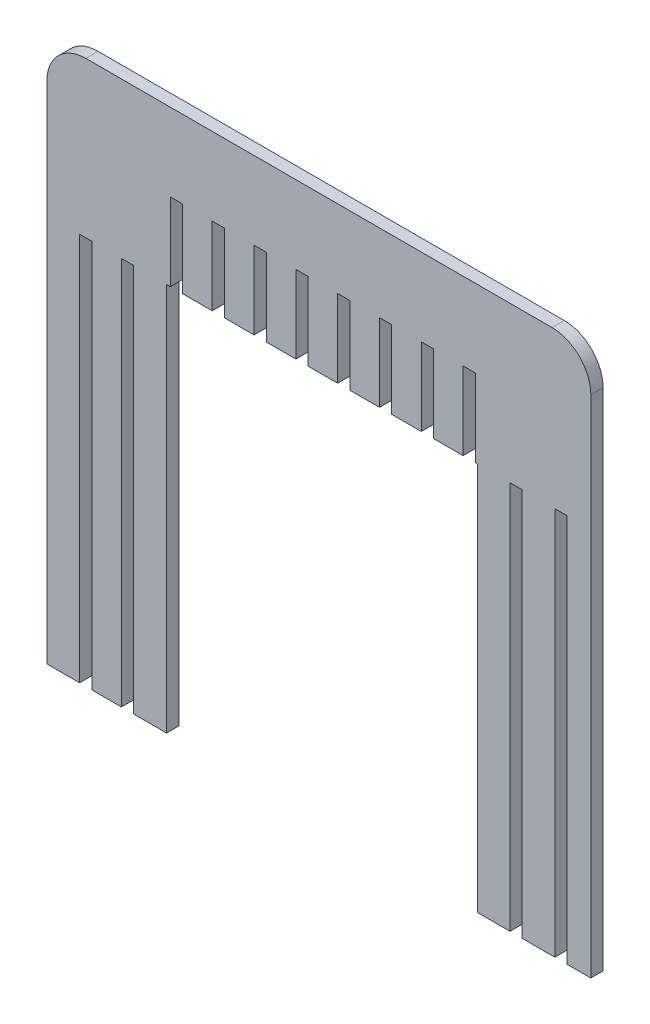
ISO-10303-21;
HEADER;
FILE_DESCRIPTION(('STEP AP214'),'2;1');
FILE_NAME('part.step','',(''),(''),'','','');
FILE_SCHEMA(('AUTOMOTIVE_DESIGN { 1 0 10303 214 1 1 1 1 }'));
ENDSEC;
DATA;
#1=APPLICATION_CONTEXT('core data for automotive mechanical design processes');
#2=APPLICATION_PROTOCOL_DEFINITION('international standard','automotive_design',2000,#1);
#3=PRODUCT_CONTEXT('',#1,'mechanical');
#4=PRODUCT('Part','Part','',(#3));
#5=PRODUCT_RELATED_PRODUCT_CATEGORY('part','',(#4));
#6=PRODUCT_DEFINITION_FORMATION('','',#4);
#7=PRODUCT_DEFINITION_CONTEXT('part definition',#1,'design');
#8=PRODUCT_DEFINITION('design','',#6,#7);
#9=PRODUCT_DEFINITION_SHAPE('','',#8);
#10=(LENGTH_UNIT() NAMED_UNIT(*) SI_UNIT(.MILLI.,.METRE.));
#11=(NAMED_UNIT(*) PLANE_ANGLE_UNIT() SI_UNIT($,.RADIAN.));
#12=(NAMED_UNIT(*) SI_UNIT($,.STERADIAN.) SOLID_ANGLE_UNIT());
#13=UNCERTAINTY_MEASURE_WITH_UNIT(LENGTH_MEASURE(1.E-05),#10,'distance_accuracy_value','');
#14=(GEOMETRIC_REPRESENTATION_CONTEXT(3) GLOBAL_UNCERTAINTY_ASSIGNED_CONTEXT((#13)) GLOBAL_UNIT_ASSIGNED_CONTEXT((#10,
#11,#12)) REPRESENTATION_CONTEXT('',''));
#15=CARTESIAN_POINT('',(0.,0.,0.));
#16=DIRECTION('',(0.,0.,1.));
#17=DIRECTION('',(1.,0.,0.));
#18=AXIS2_PLACEMENT_3D('',#15,#16,#17);
#19=CARTESIAN_POINT('',(-88.9,-88.9,4.000000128));
#20=DIRECTION('',(1.,0.,0.));
#21=DIRECTION('',(0.,0.,-1.));
#22=AXIS2_PLACEMENT_3D('',#19,#20,#21);
#23=PLANE('',#22);
#24=DIRECTION('',(0.,-1.,0.));
#25=VECTOR('',#24,1.);
#26=CARTESIAN_POINT('',(-88.9,-88.9,4.000000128));
#27=LINE('',#26,#25);
#28=CARTESIAN_POINT('',(-88.9,76.2,4.000000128));
#29=VERTEX_POINT('',#28);
#30=CARTESIAN_POINT('',(-88.9,-88.9,4.000000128));
#31=VERTEX_POINT('',#30);
#32=EDGE_CURVE('E399',#29,#31,#27,.T.);
#33=ORIENTED_EDGE('',*,*,#32,.F.);
#34=DIRECTION('',(0.,0.,-1.));
#35=VECTOR('',#34,1.);
#36=CARTESIAN_POINT('',(-88.9,76.2,4.000000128));
#37=LINE('',#36,#35);
#38=CARTESIAN_POINT('',(-88.9,76.2,0.));
#39=VERTEX_POINT('',#38);
#40=EDGE_CURVE('E436',#29,#39,#37,.T.);
#41=ORIENTED_EDGE('',*,*,#40,.T.);
#42=DIRECTION('',(0.,-1.,0.));
#43=VECTOR('',#42,1.);
#44=CARTESIAN_POINT('',(-88.9,-88.9,0.));
#45=LINE('',#44,#43);
#46=CARTESIAN_POINT('',(-88.9,-88.9,0.));
#47=VERTEX_POINT('',#46);
#48=EDGE_CURVE('E420',#39,#47,#45,.T.);
#49=ORIENTED_EDGE('',*,*,#48,.T.);
#50=DIRECTION('',(0.,0.,-1.));
#51=VECTOR('',#50,1.);
#52=CARTESIAN_POINT('',(-88.9,-88.9,4.000000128));
#53=LINE('',#52,#51);
#54=EDGE_CURVE('E414',#31,#47,#53,.T.);
#55=ORIENTED_EDGE('',*,*,#54,.F.);
#56=EDGE_LOOP('',(#33,#41,#49,#55));
#57=FACE_BOUND('',#56,.T.);
#58=ADVANCED_FACE('F35',(#57),#23,.F.);
#59=CARTESIAN_POINT('',(-88.9,-88.9,4.000000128));
#60=DIRECTION('',(0.,1.,0.));
#61=DIRECTION('',(0.,0.,1.));
#62=AXIS2_PLACEMENT_3D('',#59,#60,#61);
#63=PLANE('',#62);
#64=DIRECTION('',(1.,0.,0.));
#65=VECTOR('',#64,1.);
#66=CARTESIAN_POINT('',(-88.9,-88.9,0.));
#67=LINE('',#66,#65);
#68=CARTESIAN_POINT('',(-78.232,-88.9,0.));
#69=VERTEX_POINT('',#68);
#70=EDGE_CURVE('E441',#47,#69,#67,.T.);
#71=ORIENTED_EDGE('',*,*,#70,.T.);
#72=DIRECTION('',(0.,0.,-1.));
#73=VECTOR('',#72,1.);
#74=CARTESIAN_POINT('',(-78.232,-88.9,4.000000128));
#75=LINE('',#74,#73);
#76=CARTESIAN_POINT('',(-78.232,-88.9,4.000000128));
#77=VERTEX_POINT('',#76);
#78=EDGE_CURVE('E416',#77,#69,#75,.T.);
#79=ORIENTED_EDGE('',*,*,#78,.F.);
#80=DIRECTION('',(1.,0.,0.));
#81=VECTOR('',#80,1.);
#82=CARTESIAN_POINT('',(-88.9,-88.9,4.000000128));
#83=LINE('',#82,#81);
#84=EDGE_CURVE('E402',#31,#77,#83,.T.);
#85=ORIENTED_EDGE('',*,*,#84,.F.);
#86=ORIENTED_EDGE('',*,*,#54,.T.);
#87=EDGE_LOOP('',(#71,#79,#85,#86));
#88=FACE_BOUND('',#87,.T.);
#89=ADVANCED_FACE('F413',(#88),#63,.F.);
#90=CARTESIAN_POINT('',(-78.232,-88.9,4.000000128));
#91=DIRECTION('',(-1.,0.,0.));
#92=DIRECTION('',(0.,0.,1.));
#93=AXIS2_PLACEMENT_3D('',#90,#91,#92);
#94=PLANE('',#93);
#95=DIRECTION('',(0.,1.,0.));
#96=VECTOR('',#95,1.);
#97=CARTESIAN_POINT('',(-78.232,-88.9,0.));
#98=LINE('',#97,#96);
#99=CARTESIAN_POINT('',(-78.232,38.1,0.));
#100=VERTEX_POINT('',#99);
#101=EDGE_CURVE('E443',#69,#100,#98,.T.);
#102=ORIENTED_EDGE('',*,*,#101,.T.);
#103=DIRECTION('',(0.,0.,-1.));
#104=VECTOR('',#103,1.);
#105=CARTESIAN_POINT('',(-78.232,38.1,4.000000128));
#106=LINE('',#105,#104);
#107=CARTESIAN_POINT('',(-78.232,38.1,4.000000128));
#108=VERTEX_POINT('',#107);
#109=EDGE_CURVE('E427',#108,#100,#106,.T.);
#110=ORIENTED_EDGE('',*,*,#109,.F.);
#111=DIRECTION('',(0.,1.,0.));
#112=VECTOR('',#111,1.);
#113=CARTESIAN_POINT('',(-78.232,-88.9,4.000000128));
#114=LINE('',#113,#112);
#115=EDGE_CURVE('E418',#77,#108,#114,.T.);
#116=ORIENTED_EDGE('',*,*,#115,.F.);
#117=ORIENTED_EDGE('',*,*,#78,.T.);
#118=EDGE_LOOP('',(#102,#110,#116,#117));
#119=FACE_BOUND('',#118,.T.);
#120=ADVANCED_FACE('F846',(#119),#94,.F.);
#121=CARTESIAN_POINT('',(-78.232,38.1,4.000000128));
#122=DIRECTION('',(0.,1.,0.));
#123=DIRECTION('',(-1.,0.,0.));
#124=AXIS2_PLACEMENT_3D('',#121,#122,#123);
#125=PLANE('',#124);
#126=DIRECTION('',(1.,0.,0.));
#127=VECTOR('',#126,1.);
#128=CARTESIAN_POINT('',(-78.232,38.1,0.));
#129=LINE('',#128,#127);
#130=CARTESIAN_POINT('',(-74.231999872,38.1,0.));
#131=VERTEX_POINT('',#130);
#132=EDGE_CURVE('E450',#100,#131,#129,.T.);
#133=ORIENTED_EDGE('',*,*,#132,.T.);
#134=DIRECTION('',(0.,0.,-1.));
#135=VECTOR('',#134,1.);
#136=CARTESIAN_POINT('',(-74.231999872,38.1,4.000000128));
#137=LINE('',#136,#135);
#138=CARTESIAN_POINT('',(-74.231999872,38.1,4.000000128));
#139=VERTEX_POINT('',#138);
#140=EDGE_CURVE('E706',#139,#131,#137,.T.);
#141=ORIENTED_EDGE('',*,*,#140,.F.);
#142=DIRECTION('',(1.,0.,0.));
#143=VECTOR('',#142,1.);
#144=CARTESIAN_POINT('',(-78.232,38.1,4.000000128));
#145=LINE('',#144,#143);
#146=EDGE_CURVE('E715',#108,#139,#145,.T.);
#147=ORIENTED_EDGE('',*,*,#146,.F.);
#148=ORIENTED_EDGE('',*,*,#109,.T.);
#149=EDGE_LOOP('',(#133,#141,#147,#148));
#150=FACE_BOUND('',#149,.T.);
#151=ADVANCED_FACE('F713',(#150),#125,.F.);
#152=CARTESIAN_POINT('',(-74.231999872,-88.9,4.000000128));
#153=DIRECTION('',(1.,0.,0.));
#154=DIRECTION('',(0.,0.,-1.));
#155=AXIS2_PLACEMENT_3D('',#152,#153,#154);
#156=PLANE('',#155);
#157=DIRECTION('',(0.,-1.,0.));
#158=VECTOR('',#157,1.);
#159=CARTESIAN_POINT('',(-74.231999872,-88.9,0.));
#160=LINE('',#159,#158);
#161=CARTESIAN_POINT('',(-74.231999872,-88.9,0.));
#162=VERTEX_POINT('',#161);
#163=EDGE_CURVE('E452',#131,#162,#160,.T.);
#164=ORIENTED_EDGE('',*,*,#163,.T.);
#165=DIRECTION('',(0.,0.,-1.));
#166=VECTOR('',#165,1.);
#167=CARTESIAN_POINT('',(-74.231999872,-88.9,4.000000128));
#168=LINE('',#167,#166);
#169=CARTESIAN_POINT('',(-74.231999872,-88.9,4.000000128));
#170=VERTEX_POINT('',#169);
#171=EDGE_CURVE('E703',#170,#162,#168,.T.);
#172=ORIENTED_EDGE('',*,*,#171,.F.);
#173=DIRECTION('',(0.,-1.,0.));
#174=VECTOR('',#173,1.);
#175=CARTESIAN_POINT('',(-74.231999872,-88.9,4.000000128));
#176=LINE('',#175,#174);
#177=EDGE_CURVE('E731',#139,#170,#176,.T.);
#178=ORIENTED_EDGE('',*,*,#177,.F.);
#179=ORIENTED_EDGE('',*,*,#140,.T.);
#180=EDGE_LOOP('',(#164,#172,#178,#179));
#181=FACE_BOUND('',#180,.T.);
#182=ADVANCED_FACE('F722',(#181),#156,.F.);
#183=CARTESIAN_POINT('',(-74.231999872,-88.9,4.000000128));
#184=DIRECTION('',(0.,1.,0.));
#185=DIRECTION('',(-1.,0.,0.));
#186=AXIS2_PLACEMENT_3D('',#183,#184,#185);
#187=PLANE('',#186);
#188=DIRECTION('',(1.,0.,0.));
#189=VECTOR('',#188,1.);
#190=CARTESIAN_POINT('',(-74.231999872,-88.9,0.));
#191=LINE('',#190,#189);
#192=CARTESIAN_POINT('',(-64.563999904,-88.9,0.));
#193=VERTEX_POINT('',#192);
#194=EDGE_CURVE('E454',#162,#193,#191,.T.);
#195=ORIENTED_EDGE('',*,*,#194,.T.);
#196=DIRECTION('',(0.,0.,-1.));
#197=VECTOR('',#196,1.);
#198=CARTESIAN_POINT('',(-64.563999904,-88.9,4.000000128));
#199=LINE('',#198,#197);
#200=CARTESIAN_POINT('',(-64.563999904,-88.9,4.000000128));
#201=VERTEX_POINT('',#200);
#202=EDGE_CURVE('E700',#201,#193,#199,.T.);
#203=ORIENTED_EDGE('',*,*,#202,.F.);
#204=DIRECTION('',(1.,0.,0.));
#205=VECTOR('',#204,1.);
#206=CARTESIAN_POINT('',(-74.231999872,-88.9,4.000000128));
#207=LINE('',#206,#205);
#208=EDGE_CURVE('E728',#170,#201,#207,.T.);
#209=ORIENTED_EDGE('',*,*,#208,.F.);
#210=ORIENTED_EDGE('',*,*,#171,.T.);
#211=EDGE_LOOP('',(#195,#203,#209,#210));
#212=FACE_BOUND('',#211,.T.);
#213=ADVANCED_FACE('F726',(#212),#187,.F.);
#214=CARTESIAN_POINT('',(-64.563999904,-88.9,4.000000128));
#215=DIRECTION('',(-1.,0.,0.));
#216=DIRECTION('',(0.,0.,1.));
#217=AXIS2_PLACEMENT_3D('',#214,#215,#216);
#218=PLANE('',#217);
#219=DIRECTION('',(0.,1.,0.));
#220=VECTOR('',#219,1.);
#221=CARTESIAN_POINT('',(-64.563999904,-88.9,0.));
#222=LINE('',#221,#220);
#223=CARTESIAN_POINT('',(-64.563999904,38.1,0.));
#224=VERTEX_POINT('',#223);
#225=EDGE_CURVE('E456',#193,#224,#222,.T.);
#226=ORIENTED_EDGE('',*,*,#225,.T.);
#227=DIRECTION('',(0.,0.,-1.));
#228=VECTOR('',#227,1.);
#229=CARTESIAN_POINT('',(-64.563999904,38.1,4.000000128));
#230=LINE('',#229,#228);
#231=CARTESIAN_POINT('',(-64.563999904,38.1,4.000000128));
#232=VERTEX_POINT('',#231);
#233=EDGE_CURVE('E697',#232,#224,#230,.T.);
#234=ORIENTED_EDGE('',*,*,#233,.F.);
#235=DIRECTION('',(0.,1.,0.));
#236=VECTOR('',#235,1.);
#237=CARTESIAN_POINT('',(-64.563999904,-88.9,4.000000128));
#238=LINE('',#237,#236);
#239=EDGE_CURVE('E730',#201,#232,#238,.T.);
#240=ORIENTED_EDGE('',*,*,#239,.F.);
#241=ORIENTED_EDGE('',*,*,#202,.T.);
#242=EDGE_LOOP('',(#226,#234,#240,#241));
#243=FACE_BOUND('',#242,.T.);
#244=ADVANCED_FACE('F857',(#243),#218,.F.);
#245=CARTESIAN_POINT('',(-64.563999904,38.1,4.000000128));
#246=DIRECTION('',(0.,1.,0.));
#247=DIRECTION('',(-1.,0.,0.));
#248=AXIS2_PLACEMENT_3D('',#245,#246,#247);
#249=PLANE('',#248);
#250=DIRECTION('',(1.,0.,0.));
#251=VECTOR('',#250,1.);
#252=CARTESIAN_POINT('',(-64.563999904,38.1,0.));
#253=LINE('',#252,#251);
#254=CARTESIAN_POINT('',(-60.563999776,38.1,0.));
#255=VERTEX_POINT('',#254);
#256=EDGE_CURVE('E458',#224,#255,#253,.T.);
#257=ORIENTED_EDGE('',*,*,#256,.T.);
#258=DIRECTION('',(0.,0.,-1.));
#259=VECTOR('',#258,1.);
#260=CARTESIAN_POINT('',(-60.563999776,38.1,4.000000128));
#261=LINE('',#260,#259);
#262=CARTESIAN_POINT('',(-60.563999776,38.1,4.000000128));
#263=VERTEX_POINT('',#262);
#264=EDGE_CURVE('E694',#263,#255,#261,.T.);
#265=ORIENTED_EDGE('',*,*,#264,.F.);
#266=DIRECTION('',(1.,0.,0.));
#267=VECTOR('',#266,1.);
#268=CARTESIAN_POINT('',(-64.563999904,38.1,4.000000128));
#269=LINE('',#268,#267);
#270=EDGE_CURVE('E733',#232,#263,#269,.T.);
#271=ORIENTED_EDGE('',*,*,#270,.F.);
#272=ORIENTED_EDGE('',*,*,#233,.T.);
#273=EDGE_LOOP('',(#257,#265,#271,#272));
#274=FACE_BOUND('',#273,.T.);
#275=ADVANCED_FACE('F860',(#274),#249,.F.);
#276=CARTESIAN_POINT('',(-60.563999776,-88.9,4.000000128));
#277=DIRECTION('',(1.,0.,0.));
#278=DIRECTION('',(0.,0.,-1.));
#279=AXIS2_PLACEMENT_3D('',#276,#277,#278);
#280=PLANE('',#279);
#281=DIRECTION('',(0.,-1.,0.));
#282=VECTOR('',#281,1.);
#283=CARTESIAN_POINT('',(-60.563999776,-88.9,0.));
#284=LINE('',#283,#282);
#285=CARTESIAN_POINT('',(-60.563999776,-88.9,0.));
#286=VERTEX_POINT('',#285);
#287=EDGE_CURVE('E460',#255,#286,#284,.T.);
#288=ORIENTED_EDGE('',*,*,#287,.T.);
#289=DIRECTION('',(0.,0.,-1.));
#290=VECTOR('',#289,1.);
#291=CARTESIAN_POINT('',(-60.563999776,-88.9,4.000000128));
#292=LINE('',#291,#290);
#293=CARTESIAN_POINT('',(-60.563999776,-88.9,4.000000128));
#294=VERTEX_POINT('',#293);
#295=EDGE_CURVE('E691',#294,#286,#292,.T.);
#296=ORIENTED_EDGE('',*,*,#295,.F.);
#297=DIRECTION('',(0.,-1.,0.));
#298=VECTOR('',#297,1.);
#299=CARTESIAN_POINT('',(-60.563999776,-88.9,4.000000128));
#300=LINE('',#299,#298);
#301=EDGE_CURVE('E739',#263,#294,#300,.T.);
#302=ORIENTED_EDGE('',*,*,#301,.F.);
#303=ORIENTED_EDGE('',*,*,#264,.T.);
#304=EDGE_LOOP('',(#288,#296,#302,#303));
#305=FACE_BOUND('',#304,.T.);
#306=ADVANCED_FACE('F864',(#305),#280,.F.);
#307=CARTESIAN_POINT('',(-60.563999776,-88.9,4.000000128));
#308=DIRECTION('',(0.,1.,0.));
#309=DIRECTION('',(0.,0.,1.));
#310=AXIS2_PLACEMENT_3D('',#307,#308,#309);
#311=PLANE('',#310);
#312=DIRECTION('',(1.,0.,0.));
#313=VECTOR('',#312,1.);
#314=CARTESIAN_POINT('',(-60.563999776,-88.9,0.));
#315=LINE('',#314,#313);
#316=CARTESIAN_POINT('',(-49.799999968,-88.9,0.));
#317=VERTEX_POINT('',#316);
#318=EDGE_CURVE('E462',#286,#317,#315,.T.);
#319=ORIENTED_EDGE('',*,*,#318,.T.);
#320=DIRECTION('',(0.,0.,-1.));
#321=VECTOR('',#320,1.);
#322=CARTESIAN_POINT('',(-49.799999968,-88.9,4.000000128));
#323=LINE('',#322,#321);
#324=CARTESIAN_POINT('',(-49.799999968,-88.9,4.000000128));
#325=VERTEX_POINT('',#324);
#326=EDGE_CURVE('E688',#325,#317,#323,.T.);
#327=ORIENTED_EDGE('',*,*,#326,.F.);
#328=DIRECTION('',(1.,0.,0.));
#329=VECTOR('',#328,1.);
#330=CARTESIAN_POINT('',(-60.563999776,-88.9,4.000000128));
#331=LINE('',#330,#329);
#332=EDGE_CURVE('E741',#294,#325,#331,.T.);
#333=ORIENTED_EDGE('',*,*,#332,.F.);
#334=ORIENTED_EDGE('',*,*,#295,.T.);
#335=EDGE_LOOP('',(#319,#327,#333,#334));
#336=FACE_BOUND('',#335,.T.);
#337=ADVANCED_FACE('F868',(#336),#311,.F.);
#338=CARTESIAN_POINT('',(-49.799999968,-88.9,4.000000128));
#339=DIRECTION('',(-1.,0.,0.));
#340=DIRECTION('',(0.,0.,1.));
#341=AXIS2_PLACEMENT_3D('',#338,#339,#340);
#342=PLANE('',#341);
#343=DIRECTION('',(0.,1.,0.));
#344=VECTOR('',#343,1.);
#345=CARTESIAN_POINT('',(-49.799999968,-88.9,0.));
#346=LINE('',#345,#344);
#347=CARTESIAN_POINT('',(-49.799999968,38.1,0.));
#348=VERTEX_POINT('',#347);
#349=EDGE_CURVE('E464',#317,#348,#346,.T.);
#350=ORIENTED_EDGE('',*,*,#349,.T.);
#351=DIRECTION('',(0.,0.,-1.));
#352=VECTOR('',#351,1.);
#353=CARTESIAN_POINT('',(-49.799999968,38.1,4.000000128));
#354=LINE('',#353,#352);
#355=CARTESIAN_POINT('',(-49.799999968,38.1,4.000000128));
#356=VERTEX_POINT('',#355);
#357=EDGE_CURVE('E685',#356,#348,#354,.T.);
#358=ORIENTED_EDGE('',*,*,#357,.F.);
#359=DIRECTION('',(0.,1.,0.));
#360=VECTOR('',#359,1.);
#361=CARTESIAN_POINT('',(-49.799999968,-88.9,4.000000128));
#362=LINE('',#361,#360);
#363=EDGE_CURVE('E743',#325,#356,#362,.T.);
#364=ORIENTED_EDGE('',*,*,#363,.F.);
#365=ORIENTED_EDGE('',*,*,#326,.T.);
#366=EDGE_LOOP('',(#350,#358,#364,#365));
#367=FACE_BOUND('',#366,.T.);
#368=ADVANCED_FACE('F872',(#367),#342,.F.);
#369=CARTESIAN_POINT('',(-49.799999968,38.1,4.000000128));
#370=DIRECTION('',(0.,1.,0.));
#371=DIRECTION('',(0.,0.,1.));
#372=AXIS2_PLACEMENT_3D('',#369,#370,#371);
#373=PLANE('',#372);
#374=DIRECTION('',(1.,0.,0.));
#375=VECTOR('',#374,1.);
#376=CARTESIAN_POINT('',(-49.799999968,38.1,0.));
#377=LINE('',#376,#375);
#378=CARTESIAN_POINT('',(-48.529999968,38.1,0.));
#379=VERTEX_POINT('',#378);
#380=EDGE_CURVE('E466',#348,#379,#377,.T.);
#381=ORIENTED_EDGE('',*,*,#380,.T.);
#382=DIRECTION('',(0.,0.,-1.));
#383=VECTOR('',#382,1.);
#384=CARTESIAN_POINT('',(-48.529999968,38.1,4.000000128));
#385=LINE('',#384,#383);
#386=CARTESIAN_POINT('',(-48.529999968,38.1,4.000000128));
#387=VERTEX_POINT('',#386);
#388=EDGE_CURVE('E682',#387,#379,#385,.T.);
#389=ORIENTED_EDGE('',*,*,#388,.F.);
#390=DIRECTION('',(1.,0.,0.));
#391=VECTOR('',#390,1.);
#392=CARTESIAN_POINT('',(-49.799999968,38.1,4.000000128));
#393=LINE('',#392,#391);
#394=EDGE_CURVE('E745',#356,#387,#393,.T.);
#395=ORIENTED_EDGE('',*,*,#394,.F.);
#396=ORIENTED_EDGE('',*,*,#357,.T.);
#397=EDGE_LOOP('',(#381,#389,#395,#396));
#398=FACE_BOUND('',#397,.T.);
#399=ADVANCED_FACE('F876',(#398),#373,.F.);
#400=CARTESIAN_POINT('',(-48.529999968,38.1,4.000000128));
#401=DIRECTION('',(-1.,0.,0.));
#402=DIRECTION('',(0.,0.,1.));
#403=AXIS2_PLACEMENT_3D('',#400,#401,#402);
#404=PLANE('',#403);
#405=DIRECTION('',(0.,1.,0.));
#406=VECTOR('',#405,1.);
#407=CARTESIAN_POINT('',(-48.529999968,38.1,0.));
#408=LINE('',#407,#406);
#409=CARTESIAN_POINT('',(-48.529999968,63.5,0.));
#410=VERTEX_POINT('',#409);
#411=EDGE_CURVE('E468',#379,#410,#408,.T.);
#412=ORIENTED_EDGE('',*,*,#411,.T.);
#413=DIRECTION('',(0.,0.,-1.));
#414=VECTOR('',#413,1.);
#415=CARTESIAN_POINT('',(-48.529999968,63.5,4.000000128));
#416=LINE('',#415,#414);
#417=CARTESIAN_POINT('',(-48.529999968,63.5,4.000000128));
#418=VERTEX_POINT('',#417);
#419=EDGE_CURVE('E679',#418,#410,#416,.T.);
#420=ORIENTED_EDGE('',*,*,#419,.F.);
#421=DIRECTION('',(0.,1.,0.));
#422=VECTOR('',#421,1.);
#423=CARTESIAN_POINT('',(-48.529999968,38.1,4.000000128));
#424=LINE('',#423,#422);
#425=EDGE_CURVE('E747',#387,#418,#424,.T.);
#426=ORIENTED_EDGE('',*,*,#425,.F.);
#427=ORIENTED_EDGE('',*,*,#388,.T.);
#428=EDGE_LOOP('',(#412,#420,#426,#427));
#429=FACE_BOUND('',#428,.T.);
#430=ADVANCED_FACE('F880',(#429),#404,.F.);
#431=CARTESIAN_POINT('',(-48.529999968,63.5,4.000000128));
#432=DIRECTION('',(0.,1.,0.));
#433=DIRECTION('',(0.,0.,1.));
#434=AXIS2_PLACEMENT_3D('',#431,#432,#433);
#435=PLANE('',#434);
#436=DIRECTION('',(1.,0.,0.));
#437=VECTOR('',#436,1.);
#438=CARTESIAN_POINT('',(-48.529999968,63.5,0.));
#439=LINE('',#438,#437);
#440=CARTESIAN_POINT('',(-44.52999984,63.5,0.));
#441=VERTEX_POINT('',#440);
#442=EDGE_CURVE('E470',#410,#441,#439,.T.);
#443=ORIENTED_EDGE('',*,*,#442,.T.);
#444=DIRECTION('',(0.,0.,-1.));
#445=VECTOR('',#444,1.);
#446=CARTESIAN_POINT('',(-44.52999984,63.5,4.000000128));
#447=LINE('',#446,#445);
#448=CARTESIAN_POINT('',(-44.52999984,63.5,4.000000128));
#449=VERTEX_POINT('',#448);
#450=EDGE_CURVE('E676',#449,#441,#447,.T.);
#451=ORIENTED_EDGE('',*,*,#450,.F.);
#452=DIRECTION('',(1.,0.,0.));
#453=VECTOR('',#452,1.);
#454=CARTESIAN_POINT('',(-48.529999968,63.5,4.000000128));
#455=LINE('',#454,#453);
#456=EDGE_CURVE('E749',#418,#449,#455,.T.);
#457=ORIENTED_EDGE('',*,*,#456,.F.);
#458=ORIENTED_EDGE('',*,*,#419,.T.);
#459=EDGE_LOOP('',(#443,#451,#457,#458));
#460=FACE_BOUND('',#459,.T.);
#461=ADVANCED_FACE('F884',(#460),#435,.F.);
#462=CARTESIAN_POINT('',(-44.52999984,38.1,4.000000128));
#463=DIRECTION('',(1.,0.,0.));
#464=DIRECTION('',(0.,0.,-1.));
#465=AXIS2_PLACEMENT_3D('',#462,#463,#464);
#466=PLANE('',#465);
#467=DIRECTION('',(0.,-1.,0.));
#468=VECTOR('',#467,1.);
#469=CARTESIAN_POINT('',(-44.52999984,38.1,0.));
#470=LINE('',#469,#468);
#471=CARTESIAN_POINT('',(-44.52999984,38.1,0.));
#472=VERTEX_POINT('',#471);
#473=EDGE_CURVE('E472',#441,#472,#470,.T.);
#474=ORIENTED_EDGE('',*,*,#473,.T.);
#475=DIRECTION('',(0.,0.,-1.));
#476=VECTOR('',#475,1.);
#477=CARTESIAN_POINT('',(-44.52999984,38.1,4.000000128));
#478=LINE('',#477,#476);
#479=CARTESIAN_POINT('',(-44.52999984,38.1,4.000000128));
#480=VERTEX_POINT('',#479);
#481=EDGE_CURVE('E673',#480,#472,#478,.T.);
#482=ORIENTED_EDGE('',*,*,#481,.F.);
#483=DIRECTION('',(0.,-1.,0.));
#484=VECTOR('',#483,1.);
#485=CARTESIAN_POINT('',(-44.52999984,38.1,4.000000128));
#486=LINE('',#485,#484);
#487=EDGE_CURVE('E751',#449,#480,#486,.T.);
#488=ORIENTED_EDGE('',*,*,#487,.F.);
#489=ORIENTED_EDGE('',*,*,#450,.T.);
#490=EDGE_LOOP('',(#474,#482,#488,#489));
#491=FACE_BOUND('',#490,.T.);
#492=ADVANCED_FACE('F888',(#491),#466,.F.);
#493=CARTESIAN_POINT('',(-44.52999984,38.1,4.000000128));
#494=DIRECTION('',(0.,1.,0.));
#495=DIRECTION('',(0.,0.,1.));
#496=AXIS2_PLACEMENT_3D('',#493,#494,#495);
#497=PLANE('',#496);
#498=DIRECTION('',(1.,0.,0.));
#499=VECTOR('',#498,1.);
#500=CARTESIAN_POINT('',(-44.52999984,38.1,0.));
#501=LINE('',#500,#499);
#502=CARTESIAN_POINT('',(-34.861999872,38.1,0.));
#503=VERTEX_POINT('',#502);
#504=EDGE_CURVE('E474',#472,#503,#501,.T.);
#505=ORIENTED_EDGE('',*,*,#504,.T.);
#506=DIRECTION('',(0.,0.,-1.));
#507=VECTOR('',#506,1.);
#508=CARTESIAN_POINT('',(-34.861999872,38.1,4.000000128));
#509=LINE('',#508,#507);
#510=CARTESIAN_POINT('',(-34.861999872,38.1,4.000000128));
#511=VERTEX_POINT('',#510);
#512=EDGE_CURVE('E670',#511,#503,#509,.T.);
#513=ORIENTED_EDGE('',*,*,#512,.F.);
#514=DIRECTION('',(1.,0.,0.));
#515=VECTOR('',#514,1.);
#516=CARTESIAN_POINT('',(-44.52999984,38.1,4.000000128));
#517=LINE('',#516,#515);
#518=EDGE_CURVE('E753',#480,#511,#517,.T.);
#519=ORIENTED_EDGE('',*,*,#518,.F.);
#520=ORIENTED_EDGE('',*,*,#481,.T.);
#521=EDGE_LOOP('',(#505,#513,#519,#520));
#522=FACE_BOUND('',#521,.T.);
#523=ADVANCED_FACE('F892',(#522),#497,.F.);
#524=CARTESIAN_POINT('',(-34.861999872,38.1,4.000000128));
#525=DIRECTION('',(-1.,0.,0.));
#526=DIRECTION('',(0.,0.,1.));
#527=AXIS2_PLACEMENT_3D('',#524,#525,#526);
#528=PLANE('',#527);
#529=DIRECTION('',(0.,1.,0.));
#530=VECTOR('',#529,1.);
#531=CARTESIAN_POINT('',(-34.861999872,38.1,0.));
#532=LINE('',#531,#530);
#533=CARTESIAN_POINT('',(-34.861999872,63.5,0.));
#534=VERTEX_POINT('',#533);
#535=EDGE_CURVE('E476',#503,#534,#532,.T.);
#536=ORIENTED_EDGE('',*,*,#535,.T.);
#537=DIRECTION('',(0.,0.,-1.));
#538=VECTOR('',#537,1.);
#539=CARTESIAN_POINT('',(-34.861999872,63.5,4.000000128));
#540=LINE('',#539,#538);
#541=CARTESIAN_POINT('',(-34.861999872,63.5,4.000000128));
#542=VERTEX_POINT('',#541);
#543=EDGE_CURVE('E667',#542,#534,#540,.T.);
#544=ORIENTED_EDGE('',*,*,#543,.F.);
#545=DIRECTION('',(0.,1.,0.));
#546=VECTOR('',#545,1.);
#547=CARTESIAN_POINT('',(-34.861999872,38.1,4.000000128));
#548=LINE('',#547,#546);
#549=EDGE_CURVE('E755',#511,#542,#548,.T.);
#550=ORIENTED_EDGE('',*,*,#549,.F.);
#551=ORIENTED_EDGE('',*,*,#512,.T.);
#552=EDGE_LOOP('',(#536,#544,#550,#551));
#553=FACE_BOUND('',#552,.T.);
#554=ADVANCED_FACE('F896',(#553),#528,.F.);
#555=CARTESIAN_POINT('',(-34.861999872,63.5,4.000000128));
#556=DIRECTION('',(0.,1.,0.));
#557=DIRECTION('',(0.,0.,1.));
#558=AXIS2_PLACEMENT_3D('',#555,#556,#557);
#559=PLANE('',#558);
#560=DIRECTION('',(1.,0.,0.));
#561=VECTOR('',#560,1.);
#562=CARTESIAN_POINT('',(-34.861999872,63.5,0.));
#563=LINE('',#562,#561);
#564=CARTESIAN_POINT('',(-30.861999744,63.5,0.));
#565=VERTEX_POINT('',#564);
#566=EDGE_CURVE('E478',#534,#565,#563,.T.);
#567=ORIENTED_EDGE('',*,*,#566,.T.);
#568=DIRECTION('',(0.,0.,-1.));
#569=VECTOR('',#568,1.);
#570=CARTESIAN_POINT('',(-30.861999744,63.5,4.000000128));
#571=LINE('',#570,#569);
#572=CARTESIAN_POINT('',(-30.861999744,63.5,4.000000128));
#573=VERTEX_POINT('',#572);
#574=EDGE_CURVE('E664',#573,#565,#571,.T.);
#575=ORIENTED_EDGE('',*,*,#574,.F.);
#576=DIRECTION('',(1.,0.,0.));
#577=VECTOR('',#576,1.);
#578=CARTESIAN_POINT('',(-34.861999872,63.5,4.000000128));
#579=LINE('',#578,#577);
#580=EDGE_CURVE('E757',#542,#573,#579,.T.);
#581=ORIENTED_EDGE('',*,*,#580,.F.);
#582=ORIENTED_EDGE('',*,*,#543,.T.);
#583=EDGE_LOOP('',(#567,#575,#581,#582));
#584=FACE_BOUND('',#583,.T.);
#585=ADVANCED_FACE('F900',(#584),#559,.F.);
#586=CARTESIAN_POINT('',(-30.861999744,38.1,4.000000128));
#587=DIRECTION('',(1.,0.,0.));
#588=DIRECTION('',(0.,0.,-1.));
#589=AXIS2_PLACEMENT_3D('',#586,#587,#588);
#590=PLANE('',#589);
#591=DIRECTION('',(0.,-1.,0.));
#592=VECTOR('',#591,1.);
#593=CARTESIAN_POINT('',(-30.861999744,38.1,0.));
#594=LINE('',#593,#592);
#595=CARTESIAN_POINT('',(-30.861999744,38.1,0.));
#596=VERTEX_POINT('',#595);
#597=EDGE_CURVE('E480',#565,#596,#594,.T.);
#598=ORIENTED_EDGE('',*,*,#597,.T.);
#599=DIRECTION('',(0.,0.,-1.));
#600=VECTOR('',#599,1.);
#601=CARTESIAN_POINT('',(-30.861999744,38.1,4.000000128));
#602=LINE('',#601,#600);
#603=CARTESIAN_POINT('',(-30.861999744,38.1,4.000000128));
#604=VERTEX_POINT('',#603);
#605=EDGE_CURVE('E661',#604,#596,#602,.T.);
#606=ORIENTED_EDGE('',*,*,#605,.F.);
#607=DIRECTION('',(0.,-1.,0.));
#608=VECTOR('',#607,1.);
#609=CARTESIAN_POINT('',(-30.861999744,38.1,4.000000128));
#610=LINE('',#609,#608);
#611=EDGE_CURVE('E759',#573,#604,#610,.T.);
#612=ORIENTED_EDGE('',*,*,#611,.F.);
#613=ORIENTED_EDGE('',*,*,#574,.T.);
#614=EDGE_LOOP('',(#598,#606,#612,#613));
#615=FACE_BOUND('',#614,.T.);
#616=ADVANCED_FACE('F904',(#615),#590,.F.);
#617=CARTESIAN_POINT('',(-30.861999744,38.1,4.000000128));
#618=DIRECTION('',(0.,1.,0.));
#619=DIRECTION('',(0.,0.,1.));
#620=AXIS2_PLACEMENT_3D('',#617,#618,#619);
#621=PLANE('',#620);
#622=DIRECTION('',(1.,0.,0.));
#623=VECTOR('',#622,1.);
#624=CARTESIAN_POINT('',(-30.861999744,38.1,0.));
#625=LINE('',#624,#623);
#626=CARTESIAN_POINT('',(-21.193999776,38.1,0.));
#627=VERTEX_POINT('',#626);
#628=EDGE_CURVE('E482',#596,#627,#625,.T.);
#629=ORIENTED_EDGE('',*,*,#628,.T.);
#630=DIRECTION('',(0.,0.,-1.));
#631=VECTOR('',#630,1.);
#632=CARTESIAN_POINT('',(-21.193999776,38.1,4.000000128));
#633=LINE('',#632,#631);
#634=CARTESIAN_POINT('',(-21.193999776,38.1,4.000000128));
#635=VERTEX_POINT('',#634);
#636=EDGE_CURVE('E658',#635,#627,#633,.T.);
#637=ORIENTED_EDGE('',*,*,#636,.F.);
#638=DIRECTION('',(1.,0.,0.));
#639=VECTOR('',#638,1.);
#640=CARTESIAN_POINT('',(-30.861999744,38.1,4.000000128));
#641=LINE('',#640,#639);
#642=EDGE_CURVE('E761',#604,#635,#641,.T.);
#643=ORIENTED_EDGE('',*,*,#642,.F.);
#644=ORIENTED_EDGE('',*,*,#605,.T.);
#645=EDGE_LOOP('',(#629,#637,#643,#644));
#646=FACE_BOUND('',#645,.T.);
#647=ADVANCED_FACE('F908',(#646),#621,.F.);
#648=CARTESIAN_POINT('',(-21.193999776,38.1,4.000000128));
#649=DIRECTION('',(-1.,0.,0.));
#650=DIRECTION('',(0.,0.,1.));
#651=AXIS2_PLACEMENT_3D('',#648,#649,#650);
#652=PLANE('',#651);
#653=DIRECTION('',(0.,1.,0.));
#654=VECTOR('',#653,1.);
#655=CARTESIAN_POINT('',(-21.193999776,38.1,0.));
#656=LINE('',#655,#654);
#657=CARTESIAN_POINT('',(-21.193999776,63.5,0.));
#658=VERTEX_POINT('',#657);
#659=EDGE_CURVE('E484',#627,#658,#656,.T.);
#660=ORIENTED_EDGE('',*,*,#659,.T.);
#661=DIRECTION('',(0.,0.,-1.));
#662=VECTOR('',#661,1.);
#663=CARTESIAN_POINT('',(-21.193999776,63.5,4.000000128));
#664=LINE('',#663,#662);
#665=CARTESIAN_POINT('',(-21.193999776,63.5,4.000000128));
#666=VERTEX_POINT('',#665);
#667=EDGE_CURVE('E655',#666,#658,#664,.T.);
#668=ORIENTED_EDGE('',*,*,#667,.F.);
#669=DIRECTION('',(0.,1.,0.));
#670=VECTOR('',#669,1.);
#671=CARTESIAN_POINT('',(-21.193999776,38.1,4.000000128));
#672=LINE('',#671,#670);
#673=EDGE_CURVE('E763',#635,#666,#672,.T.);
#674=ORIENTED_EDGE('',*,*,#673,.F.);
#675=ORIENTED_EDGE('',*,*,#636,.T.);
#676=EDGE_LOOP('',(#660,#668,#674,#675));
#677=FACE_BOUND('',#676,.T.);
#678=ADVANCED_FACE('F912',(#677),#652,.F.);
#679=CARTESIAN_POINT('',(-21.193999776,63.5,4.000000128));
#680=DIRECTION('',(0.,1.,0.));
#681=DIRECTION('',(0.,0.,1.));
#682=AXIS2_PLACEMENT_3D('',#679,#680,#681);
#683=PLANE('',#682);
#684=DIRECTION('',(1.,0.,0.));
#685=VECTOR('',#684,1.);
#686=CARTESIAN_POINT('',(-21.193999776,63.5,0.));
#687=LINE('',#686,#685);
#688=CARTESIAN_POINT('',(-17.193999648,63.5,0.));
#689=VERTEX_POINT('',#688);
#690=EDGE_CURVE('E486',#658,#689,#687,.T.);
#691=ORIENTED_EDGE('',*,*,#690,.T.);
#692=DIRECTION('',(0.,0.,-1.));
#693=VECTOR('',#692,1.);
#694=CARTESIAN_POINT('',(-17.193999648,63.5,4.000000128));
#695=LINE('',#694,#693);
#696=CARTESIAN_POINT('',(-17.193999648,63.5,4.000000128));
#697=VERTEX_POINT('',#696);
#698=EDGE_CURVE('E652',#697,#689,#695,.T.);
#699=ORIENTED_EDGE('',*,*,#698,.F.);
#700=DIRECTION('',(1.,0.,0.));
#701=VECTOR('',#700,1.);
#702=CARTESIAN_POINT('',(-21.193999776,63.5,4.000000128));
#703=LINE('',#702,#701);
#704=EDGE_CURVE('E765',#666,#697,#703,.T.);
#705=ORIENTED_EDGE('',*,*,#704,.F.);
#706=ORIENTED_EDGE('',*,*,#667,.T.);
#707=EDGE_LOOP('',(#691,#699,#705,#706));
#708=FACE_BOUND('',#707,.T.);
#709=ADVANCED_FACE('F916',(#708),#683,.F.);
#710=CARTESIAN_POINT('',(-17.193999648,38.1,4.000000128));
#711=DIRECTION('',(1.,0.,0.));
#712=DIRECTION('',(0.,0.,-1.));
#713=AXIS2_PLACEMENT_3D('',#710,#711,#712);
#714=PLANE('',#713);
#715=DIRECTION('',(0.,-1.,0.));
#716=VECTOR('',#715,1.);
#717=CARTESIAN_POINT('',(-17.193999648,38.1,0.));
#718=LINE('',#717,#716);
#719=CARTESIAN_POINT('',(-17.193999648,38.1,0.));
#720=VERTEX_POINT('',#719);
#721=EDGE_CURVE('E488',#689,#720,#718,.T.);
#722=ORIENTED_EDGE('',*,*,#721,.T.);
#723=DIRECTION('',(0.,0.,-1.));
#724=VECTOR('',#723,1.);
#725=CARTESIAN_POINT('',(-17.193999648,38.1,4.000000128));
#726=LINE('',#725,#724);
#727=CARTESIAN_POINT('',(-17.193999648,38.1,4.000000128));
#728=VERTEX_POINT('',#727);
#729=EDGE_CURVE('E649',#728,#720,#726,.T.);
#730=ORIENTED_EDGE('',*,*,#729,.F.);
#731=DIRECTION('',(0.,-1.,0.));
#732=VECTOR('',#731,1.);
#733=CARTESIAN_POINT('',(-17.193999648,38.1,4.000000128));
#734=LINE('',#733,#732);
#735=EDGE_CURVE('E767',#697,#728,#734,.T.);
#736=ORIENTED_EDGE('',*,*,#735,.F.);
#737=ORIENTED_EDGE('',*,*,#698,.T.);
#738=EDGE_LOOP('',(#722,#730,#736,#737));
#739=FACE_BOUND('',#738,.T.);
#740=ADVANCED_FACE('F920',(#739),#714,.F.);
#741=CARTESIAN_POINT('',(-17.193999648,38.1,4.000000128));
#742=DIRECTION('',(0.,1.,0.));
#743=DIRECTION('',(0.,0.,1.));
#744=AXIS2_PLACEMENT_3D('',#741,#742,#743);
#745=PLANE('',#744);
#746=DIRECTION('',(1.,0.,0.));
#747=VECTOR('',#746,1.);
#748=CARTESIAN_POINT('',(-17.193999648,38.1,0.));
#749=LINE('',#748,#747);
#750=CARTESIAN_POINT('',(-7.52599967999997,38.1,0.));
#751=VERTEX_POINT('',#750);
#752=EDGE_CURVE('E490',#720,#751,#749,.T.);
#753=ORIENTED_EDGE('',*,*,#752,.T.);
#754=DIRECTION('',(0.,0.,-1.));
#755=VECTOR('',#754,1.);
#756=CARTESIAN_POINT('',(-7.52599967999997,38.1,4.000000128));
#757=LINE('',#756,#755);
#758=CARTESIAN_POINT('',(-7.52599967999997,38.1,4.000000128));
#759=VERTEX_POINT('',#758);
#760=EDGE_CURVE('E646',#759,#751,#757,.T.);
#761=ORIENTED_EDGE('',*,*,#760,.F.);
#762=DIRECTION('',(1.,0.,0.));
#763=VECTOR('',#762,1.);
#764=CARTESIAN_POINT('',(-17.193999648,38.1,4.000000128));
#765=LINE('',#764,#763);
#766=EDGE_CURVE('E769',#728,#759,#765,.T.);
#767=ORIENTED_EDGE('',*,*,#766,.F.);
#768=ORIENTED_EDGE('',*,*,#729,.T.);
#769=EDGE_LOOP('',(#753,#761,#767,#768));
#770=FACE_BOUND('',#769,.T.);
#771=ADVANCED_FACE('F924',(#770),#745,.F.);
#772=CARTESIAN_POINT('',(-7.52599967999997,38.1,4.000000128));
#773=DIRECTION('',(-1.,0.,0.));
#774=DIRECTION('',(0.,0.,1.));
#775=AXIS2_PLACEMENT_3D('',#772,#773,#774);
#776=PLANE('',#775);
#777=DIRECTION('',(0.,1.,0.));
#778=VECTOR('',#777,1.);
#779=CARTESIAN_POINT('',(-7.52599967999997,38.1,0.));
#780=LINE('',#779,#778);
#781=CARTESIAN_POINT('',(-7.52599967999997,63.5,0.));
#782=VERTEX_POINT('',#781);
#783=EDGE_CURVE('E492',#751,#782,#780,.T.);
#784=ORIENTED_EDGE('',*,*,#783,.T.);
#785=DIRECTION('',(0.,0.,-1.));
#786=VECTOR('',#785,1.);
#787=CARTESIAN_POINT('',(-7.52599967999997,63.5,4.000000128));
#788=LINE('',#787,#786);
#789=CARTESIAN_POINT('',(-7.52599967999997,63.5,4.000000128));
#790=VERTEX_POINT('',#789);
#791=EDGE_CURVE('E643',#790,#782,#788,.T.);
#792=ORIENTED_EDGE('',*,*,#791,.F.);
#793=DIRECTION('',(0.,1.,0.));
#794=VECTOR('',#793,1.);
#795=CARTESIAN_POINT('',(-7.52599967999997,38.1,4.000000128));
#796=LINE('',#795,#794);
#797=EDGE_CURVE('E771',#759,#790,#796,.T.);
#798=ORIENTED_EDGE('',*,*,#797,.F.);
#799=ORIENTED_EDGE('',*,*,#760,.T.);
#800=EDGE_LOOP('',(#784,#792,#798,#799));
#801=FACE_BOUND('',#800,.T.);
#802=ADVANCED_FACE('F928',(#801),#776,.F.);
#803=CARTESIAN_POINT('',(-7.52599967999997,63.5,4.000000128));
#804=DIRECTION('',(0.,1.,0.));
#805=DIRECTION('',(0.,0.,1.));
#806=AXIS2_PLACEMENT_3D('',#803,#804,#805);
#807=PLANE('',#806);
#808=DIRECTION('',(1.,0.,0.));
#809=VECTOR('',#808,1.);
#810=CARTESIAN_POINT('',(-7.52599967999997,63.5,0.));
#811=LINE('',#810,#809);
#812=CARTESIAN_POINT('',(-3.52599955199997,63.5,0.));
#813=VERTEX_POINT('',#812);
#814=EDGE_CURVE('E494',#782,#813,#811,.T.);
#815=ORIENTED_EDGE('',*,*,#814,.T.);
#816=DIRECTION('',(0.,0.,-1.));
#817=VECTOR('',#816,1.);
#818=CARTESIAN_POINT('',(-3.52599955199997,63.5,4.000000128));
#819=LINE('',#818,#817);
#820=CARTESIAN_POINT('',(-3.52599955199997,63.5,4.000000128));
#821=VERTEX_POINT('',#820);
#822=EDGE_CURVE('E640',#821,#813,#819,.T.);
#823=ORIENTED_EDGE('',*,*,#822,.F.);
#824=DIRECTION('',(1.,0.,0.));
#825=VECTOR('',#824,1.);
#826=CARTESIAN_POINT('',(-7.52599967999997,63.5,4.000000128));
#827=LINE('',#826,#825);
#828=EDGE_CURVE('E773',#790,#821,#827,.T.);
#829=ORIENTED_EDGE('',*,*,#828,.F.);
#830=ORIENTED_EDGE('',*,*,#791,.T.);
#831=EDGE_LOOP('',(#815,#823,#829,#830));
#832=FACE_BOUND('',#831,.T.);
#833=ADVANCED_FACE('F932',(#832),#807,.F.);
#834=CARTESIAN_POINT('',(-3.52599955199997,38.1,4.000000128));
#835=DIRECTION('',(1.,0.,0.));
#836=DIRECTION('',(0.,0.,-1.));
#837=AXIS2_PLACEMENT_3D('',#834,#835,#836);
#838=PLANE('',#837);
#839=DIRECTION('',(0.,-1.,0.));
#840=VECTOR('',#839,1.);
#841=CARTESIAN_POINT('',(-3.52599955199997,38.1,0.));
#842=LINE('',#841,#840);
#843=CARTESIAN_POINT('',(-3.52599955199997,38.1,0.));
#844=VERTEX_POINT('',#843);
#845=EDGE_CURVE('E496',#813,#844,#842,.T.);
#846=ORIENTED_EDGE('',*,*,#845,.T.);
#847=DIRECTION('',(0.,0.,-1.));
#848=VECTOR('',#847,1.);
#849=CARTESIAN_POINT('',(-3.52599955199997,38.1,4.000000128));
#850=LINE('',#849,#848);
#851=CARTESIAN_POINT('',(-3.52599955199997,38.1,4.000000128));
#852=VERTEX_POINT('',#851);
#853=EDGE_CURVE('E637',#852,#844,#850,.T.);
#854=ORIENTED_EDGE('',*,*,#853,.F.);
#855=DIRECTION('',(0.,-1.,0.));
#856=VECTOR('',#855,1.);
#857=CARTESIAN_POINT('',(-3.52599955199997,38.1,4.000000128));
#858=LINE('',#857,#856);
#859=EDGE_CURVE('E775',#821,#852,#858,.T.);
#860=ORIENTED_EDGE('',*,*,#859,.F.);
#861=ORIENTED_EDGE('',*,*,#822,.T.);
#862=EDGE_LOOP('',(#846,#854,#860,#861));
#863=FACE_BOUND('',#862,.T.);
#864=ADVANCED_FACE('F936',(#863),#838,.F.);
#865=CARTESIAN_POINT('',(-3.52599955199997,38.1,4.000000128));
#866=DIRECTION('',(0.,1.,0.));
#867=DIRECTION('',(0.,0.,1.));
#868=AXIS2_PLACEMENT_3D('',#865,#866,#867);
#869=PLANE('',#868);
#870=DIRECTION('',(1.,0.,0.));
#871=VECTOR('',#870,1.);
#872=CARTESIAN_POINT('',(-3.52599955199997,38.1,0.));
#873=LINE('',#872,#871);
#874=CARTESIAN_POINT('',(6.14200041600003,38.1,0.));
#875=VERTEX_POINT('',#874);
#876=EDGE_CURVE('E498',#844,#875,#873,.T.);
#877=ORIENTED_EDGE('',*,*,#876,.T.);
#878=DIRECTION('',(0.,0.,-1.));
#879=VECTOR('',#878,1.);
#880=CARTESIAN_POINT('',(6.14200041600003,38.1,4.000000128));
#881=LINE('',#880,#879);
#882=CARTESIAN_POINT('',(6.14200041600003,38.1,4.000000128));
#883=VERTEX_POINT('',#882);
#884=EDGE_CURVE('E634',#883,#875,#881,.T.);
#885=ORIENTED_EDGE('',*,*,#884,.F.);
#886=DIRECTION('',(1.,0.,0.));
#887=VECTOR('',#886,1.);
#888=CARTESIAN_POINT('',(-3.52599955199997,38.1,4.000000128));
#889=LINE('',#888,#887);
#890=EDGE_CURVE('E777',#852,#883,#889,.T.);
#891=ORIENTED_EDGE('',*,*,#890,.F.);
#892=ORIENTED_EDGE('',*,*,#853,.T.);
#893=EDGE_LOOP('',(#877,#885,#891,#892));
#894=FACE_BOUND('',#893,.T.);
#895=ADVANCED_FACE('F940',(#894),#869,.F.);
#896=CARTESIAN_POINT('',(6.14200041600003,38.1,4.000000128));
#897=DIRECTION('',(-1.,0.,0.));
#898=DIRECTION('',(0.,0.,1.));
#899=AXIS2_PLACEMENT_3D('',#896,#897,#898);
#900=PLANE('',#899);
#901=DIRECTION('',(0.,1.,0.));
#902=VECTOR('',#901,1.);
#903=CARTESIAN_POINT('',(6.14200041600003,38.1,0.));
#904=LINE('',#903,#902);
#905=CARTESIAN_POINT('',(6.14200041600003,63.5,0.));
#906=VERTEX_POINT('',#905);
#907=EDGE_CURVE('E500',#875,#906,#904,.T.);
#908=ORIENTED_EDGE('',*,*,#907,.T.);
#909=DIRECTION('',(0.,0.,-1.));
#910=VECTOR('',#909,1.);
#911=CARTESIAN_POINT('',(6.14200041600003,63.5,4.000000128));
#912=LINE('',#911,#910);
#913=CARTESIAN_POINT('',(6.14200041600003,63.5,4.000000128));
#914=VERTEX_POINT('',#913);
#915=EDGE_CURVE('E631',#914,#906,#912,.T.);
#916=ORIENTED_EDGE('',*,*,#915,.F.);
#917=DIRECTION('',(0.,1.,0.));
#918=VECTOR('',#917,1.);
#919=CARTESIAN_POINT('',(6.14200041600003,38.1,4.000000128));
#920=LINE('',#919,#918);
#921=EDGE_CURVE('E779',#883,#914,#920,.T.);
#922=ORIENTED_EDGE('',*,*,#921,.F.);
#923=ORIENTED_EDGE('',*,*,#884,.T.);
#924=EDGE_LOOP('',(#908,#916,#922,#923));
#925=FACE_BOUND('',#924,.T.);
#926=ADVANCED_FACE('F944',(#925),#900,.F.);
#927=CARTESIAN_POINT('',(6.14200041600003,63.5,4.000000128));
#928=DIRECTION('',(0.,1.,0.));
#929=DIRECTION('',(0.,0.,1.));
#930=AXIS2_PLACEMENT_3D('',#927,#928,#929);
#931=PLANE('',#930);
#932=DIRECTION('',(1.,0.,0.));
#933=VECTOR('',#932,1.);
#934=CARTESIAN_POINT('',(6.14200041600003,63.5,0.));
#935=LINE('',#934,#933);
#936=CARTESIAN_POINT('',(10.142000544,63.5,0.));
#937=VERTEX_POINT('',#936);
#938=EDGE_CURVE('E502',#906,#937,#935,.T.);
#939=ORIENTED_EDGE('',*,*,#938,.T.);
#940=DIRECTION('',(0.,0.,-1.));
#941=VECTOR('',#940,1.);
#942=CARTESIAN_POINT('',(10.142000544,63.5,4.000000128));
#943=LINE('',#942,#941);
#944=CARTESIAN_POINT('',(10.142000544,63.5,4.000000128));
#945=VERTEX_POINT('',#944);
#946=EDGE_CURVE('E628',#945,#937,#943,.T.);
#947=ORIENTED_EDGE('',*,*,#946,.F.);
#948=DIRECTION('',(1.,0.,0.));
#949=VECTOR('',#948,1.);
#950=CARTESIAN_POINT('',(6.14200041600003,63.5,4.000000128));
#951=LINE('',#950,#949);
#952=EDGE_CURVE('E781',#914,#945,#951,.T.);
#953=ORIENTED_EDGE('',*,*,#952,.F.);
#954=ORIENTED_EDGE('',*,*,#915,.T.);
#955=EDGE_LOOP('',(#939,#947,#953,#954));
#956=FACE_BOUND('',#955,.T.);
#957=ADVANCED_FACE('F948',(#956),#931,.F.);
#958=CARTESIAN_POINT('',(10.142000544,38.1,4.000000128));
#959=DIRECTION('',(1.,0.,0.));
#960=DIRECTION('',(0.,0.,-1.));
#961=AXIS2_PLACEMENT_3D('',#958,#959,#960);
#962=PLANE('',#961);
#963=DIRECTION('',(0.,-1.,0.));
#964=VECTOR('',#963,1.);
#965=CARTESIAN_POINT('',(10.142000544,38.1,0.));
#966=LINE('',#965,#964);
#967=CARTESIAN_POINT('',(10.142000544,38.1,0.));
#968=VERTEX_POINT('',#967);
#969=EDGE_CURVE('E504',#937,#968,#966,.T.);
#970=ORIENTED_EDGE('',*,*,#969,.T.);
#971=DIRECTION('',(0.,0.,-1.));
#972=VECTOR('',#971,1.);
#973=CARTESIAN_POINT('',(10.142000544,38.1,4.000000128));
#974=LINE('',#973,#972);
#975=CARTESIAN_POINT('',(10.142000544,38.1,4.000000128));
#976=VERTEX_POINT('',#975);
#977=EDGE_CURVE('E625',#976,#968,#974,.T.);
#978=ORIENTED_EDGE('',*,*,#977,.F.);
#979=DIRECTION('',(0.,-1.,0.));
#980=VECTOR('',#979,1.);
#981=CARTESIAN_POINT('',(10.142000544,38.1,4.000000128));
#982=LINE('',#981,#980);
#983=EDGE_CURVE('E783',#945,#976,#982,.T.);
#984=ORIENTED_EDGE('',*,*,#983,.F.);
#985=ORIENTED_EDGE('',*,*,#946,.T.);
#986=EDGE_LOOP('',(#970,#978,#984,#985));
#987=FACE_BOUND('',#986,.T.);
#988=ADVANCED_FACE('F952',(#987),#962,.F.);
#989=CARTESIAN_POINT('',(10.142000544,38.1,4.000000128));
#990=DIRECTION('',(0.,1.,0.));
#991=DIRECTION('',(0.,0.,1.));
#992=AXIS2_PLACEMENT_3D('',#989,#990,#991);
#993=PLANE('',#992);
#994=DIRECTION('',(1.,0.,0.));
#995=VECTOR('',#994,1.);
#996=CARTESIAN_POINT('',(10.142000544,38.1,0.));
#997=LINE('',#996,#995);
#998=CARTESIAN_POINT('',(19.810000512,38.1,0.));
#999=VERTEX_POINT('',#998);
#1000=EDGE_CURVE('E506',#968,#999,#997,.T.);
#1001=ORIENTED_EDGE('',*,*,#1000,.T.);
#1002=DIRECTION('',(0.,0.,-1.));
#1003=VECTOR('',#1002,1.);
#1004=CARTESIAN_POINT('',(19.810000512,38.1,4.000000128));
#1005=LINE('',#1004,#1003);
#1006=CARTESIAN_POINT('',(19.810000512,38.1,4.000000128));
#1007=VERTEX_POINT('',#1006);
#1008=EDGE_CURVE('E622',#1007,#999,#1005,.T.);
#1009=ORIENTED_EDGE('',*,*,#1008,.F.);
#1010=DIRECTION('',(1.,0.,0.));
#1011=VECTOR('',#1010,1.);
#1012=CARTESIAN_POINT('',(10.142000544,38.1,4.000000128));
#1013=LINE('',#1012,#1011);
#1014=EDGE_CURVE('E785',#976,#1007,#1013,.T.);
#1015=ORIENTED_EDGE('',*,*,#1014,.F.);
#1016=ORIENTED_EDGE('',*,*,#977,.T.);
#1017=EDGE_LOOP('',(#1001,#1009,#1015,#1016));
#1018=FACE_BOUND('',#1017,.T.);
#1019=ADVANCED_FACE('F956',(#1018),#993,.F.);
#1020=CARTESIAN_POINT('',(19.810000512,38.1,4.000000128));
#1021=DIRECTION('',(-1.,0.,0.));
#1022=DIRECTION('',(0.,0.,1.));
#1023=AXIS2_PLACEMENT_3D('',#1020,#1021,#1022);
#1024=PLANE('',#1023);
#1025=DIRECTION('',(0.,1.,0.));
#1026=VECTOR('',#1025,1.);
#1027=CARTESIAN_POINT('',(19.810000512,38.1,0.));
#1028=LINE('',#1027,#1026);
#1029=CARTESIAN_POINT('',(19.810000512,63.5,0.));
#1030=VERTEX_POINT('',#1029);
#1031=EDGE_CURVE('E508',#999,#1030,#1028,.T.);
#1032=ORIENTED_EDGE('',*,*,#1031,.T.);
#1033=DIRECTION('',(0.,0.,-1.));
#1034=VECTOR('',#1033,1.);
#1035=CARTESIAN_POINT('',(19.810000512,63.5,4.000000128));
#1036=LINE('',#1035,#1034);
#1037=CARTESIAN_POINT('',(19.810000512,63.5,4.000000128));
#1038=VERTEX_POINT('',#1037);
#1039=EDGE_CURVE('E619',#1038,#1030,#1036,.T.);
#1040=ORIENTED_EDGE('',*,*,#1039,.F.);
#1041=DIRECTION('',(0.,1.,0.));
#1042=VECTOR('',#1041,1.);
#1043=CARTESIAN_POINT('',(19.810000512,38.1,4.000000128));
#1044=LINE('',#1043,#1042);
#1045=EDGE_CURVE('E787',#1007,#1038,#1044,.T.);
#1046=ORIENTED_EDGE('',*,*,#1045,.F.);
#1047=ORIENTED_EDGE('',*,*,#1008,.T.);
#1048=EDGE_LOOP('',(#1032,#1040,#1046,#1047));
#1049=FACE_BOUND('',#1048,.T.);
#1050=ADVANCED_FACE('F960',(#1049),#1024,.F.);
#1051=CARTESIAN_POINT('',(19.810000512,63.5,4.000000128));
#1052=DIRECTION('',(0.,1.,0.));
#1053=DIRECTION('',(0.,0.,1.));
#1054=AXIS2_PLACEMENT_3D('',#1051,#1052,#1053);
#1055=PLANE('',#1054);
#1056=DIRECTION('',(1.,0.,0.));
#1057=VECTOR('',#1056,1.);
#1058=CARTESIAN_POINT('',(19.810000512,63.5,0.));
#1059=LINE('',#1058,#1057);
#1060=CARTESIAN_POINT('',(23.81000064,63.5,0.));
#1061=VERTEX_POINT('',#1060);
#1062=EDGE_CURVE('E510',#1030,#1061,#1059,.T.);
#1063=ORIENTED_EDGE('',*,*,#1062,.T.);
#1064=DIRECTION('',(0.,0.,-1.));
#1065=VECTOR('',#1064,1.);
#1066=CARTESIAN_POINT('',(23.81000064,63.5,4.000000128));
#1067=LINE('',#1066,#1065);
#1068=CARTESIAN_POINT('',(23.81000064,63.5,4.000000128));
#1069=VERTEX_POINT('',#1068);
#1070=EDGE_CURVE('E616',#1069,#1061,#1067,.T.);
#1071=ORIENTED_EDGE('',*,*,#1070,.F.);
#1072=DIRECTION('',(1.,0.,0.));
#1073=VECTOR('',#1072,1.);
#1074=CARTESIAN_POINT('',(19.810000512,63.5,4.000000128));
#1075=LINE('',#1074,#1073);
#1076=EDGE_CURVE('E789',#1038,#1069,#1075,.T.);
#1077=ORIENTED_EDGE('',*,*,#1076,.F.);
#1078=ORIENTED_EDGE('',*,*,#1039,.T.);
#1079=EDGE_LOOP('',(#1063,#1071,#1077,#1078));
#1080=FACE_BOUND('',#1079,.T.);
#1081=ADVANCED_FACE('F964',(#1080),#1055,.F.);
#1082=CARTESIAN_POINT('',(23.81000064,38.1,4.000000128));
#1083=DIRECTION('',(1.,0.,0.));
#1084=DIRECTION('',(0.,0.,-1.));
#1085=AXIS2_PLACEMENT_3D('',#1082,#1083,#1084);
#1086=PLANE('',#1085);
#1087=DIRECTION('',(0.,-1.,0.));
#1088=VECTOR('',#1087,1.);
#1089=CARTESIAN_POINT('',(23.81000064,38.1,0.));
#1090=LINE('',#1089,#1088);
#1091=CARTESIAN_POINT('',(23.81000064,38.1,0.));
#1092=VERTEX_POINT('',#1091);
#1093=EDGE_CURVE('E512',#1061,#1092,#1090,.T.);
#1094=ORIENTED_EDGE('',*,*,#1093,.T.);
#1095=DIRECTION('',(0.,0.,-1.));
#1096=VECTOR('',#1095,1.);
#1097=CARTESIAN_POINT('',(23.81000064,38.1,4.000000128));
#1098=LINE('',#1097,#1096);
#1099=CARTESIAN_POINT('',(23.81000064,38.1,4.000000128));
#1100=VERTEX_POINT('',#1099);
#1101=EDGE_CURVE('E613',#1100,#1092,#1098,.T.);
#1102=ORIENTED_EDGE('',*,*,#1101,.F.);
#1103=DIRECTION('',(0.,-1.,0.));
#1104=VECTOR('',#1103,1.);
#1105=CARTESIAN_POINT('',(23.81000064,38.1,4.000000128));
#1106=LINE('',#1105,#1104);
#1107=EDGE_CURVE('E791',#1069,#1100,#1106,.T.);
#1108=ORIENTED_EDGE('',*,*,#1107,.F.);
#1109=ORIENTED_EDGE('',*,*,#1070,.T.);
#1110=EDGE_LOOP('',(#1094,#1102,#1108,#1109));
#1111=FACE_BOUND('',#1110,.T.);
#1112=ADVANCED_FACE('F968',(#1111),#1086,.F.);
#1113=CARTESIAN_POINT('',(23.81000064,38.1,4.000000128));
#1114=DIRECTION('',(0.,1.,0.));
#1115=DIRECTION('',(0.,0.,1.));
#1116=AXIS2_PLACEMENT_3D('',#1113,#1114,#1115);
#1117=PLANE('',#1116);
#1118=DIRECTION('',(1.,0.,0.));
#1119=VECTOR('',#1118,1.);
#1120=CARTESIAN_POINT('',(23.81000064,38.1,0.));
#1121=LINE('',#1120,#1119);
#1122=CARTESIAN_POINT('',(33.478000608,38.1,0.));
#1123=VERTEX_POINT('',#1122);
#1124=EDGE_CURVE('E514',#1092,#1123,#1121,.T.);
#1125=ORIENTED_EDGE('',*,*,#1124,.T.);
#1126=DIRECTION('',(0.,0.,-1.));
#1127=VECTOR('',#1126,1.);
#1128=CARTESIAN_POINT('',(33.478000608,38.1,4.000000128));
#1129=LINE('',#1128,#1127);
#1130=CARTESIAN_POINT('',(33.478000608,38.1,4.000000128));
#1131=VERTEX_POINT('',#1130);
#1132=EDGE_CURVE('E610',#1131,#1123,#1129,.T.);
#1133=ORIENTED_EDGE('',*,*,#1132,.F.);
#1134=DIRECTION('',(1.,0.,0.));
#1135=VECTOR('',#1134,1.);
#1136=CARTESIAN_POINT('',(23.81000064,38.1,4.000000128));
#1137=LINE('',#1136,#1135);
#1138=EDGE_CURVE('E793',#1100,#1131,#1137,.T.);
#1139=ORIENTED_EDGE('',*,*,#1138,.F.);
#1140=ORIENTED_EDGE('',*,*,#1101,.T.);
#1141=EDGE_LOOP('',(#1125,#1133,#1139,#1140));
#1142=FACE_BOUND('',#1141,.T.);
#1143=ADVANCED_FACE('F972',(#1142),#1117,.F.);
#1144=CARTESIAN_POINT('',(33.478000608,38.1,4.000000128));
#1145=DIRECTION('',(-1.,0.,0.));
#1146=DIRECTION('',(0.,0.,1.));
#1147=AXIS2_PLACEMENT_3D('',#1144,#1145,#1146);
#1148=PLANE('',#1147);
#1149=DIRECTION('',(0.,1.,0.));
#1150=VECTOR('',#1149,1.);
#1151=CARTESIAN_POINT('',(33.478000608,38.1,0.));
#1152=LINE('',#1151,#1150);
#1153=CARTESIAN_POINT('',(33.478000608,63.5,0.));
#1154=VERTEX_POINT('',#1153);
#1155=EDGE_CURVE('E516',#1123,#1154,#1152,.T.);
#1156=ORIENTED_EDGE('',*,*,#1155,.T.);
#1157=DIRECTION('',(0.,0.,-1.));
#1158=VECTOR('',#1157,1.);
#1159=CARTESIAN_POINT('',(33.478000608,63.5,4.000000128));
#1160=LINE('',#1159,#1158);
#1161=CARTESIAN_POINT('',(33.478000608,63.5,4.000000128));
#1162=VERTEX_POINT('',#1161);
#1163=EDGE_CURVE('E607',#1162,#1154,#1160,.T.);
#1164=ORIENTED_EDGE('',*,*,#1163,.F.);
#1165=DIRECTION('',(0.,1.,0.));
#1166=VECTOR('',#1165,1.);
#1167=CARTESIAN_POINT('',(33.478000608,38.1,4.000000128));
#1168=LINE('',#1167,#1166);
#1169=EDGE_CURVE('E795',#1131,#1162,#1168,.T.);
#1170=ORIENTED_EDGE('',*,*,#1169,.F.);
#1171=ORIENTED_EDGE('',*,*,#1132,.T.);
#1172=EDGE_LOOP('',(#1156,#1164,#1170,#1171));
#1173=FACE_BOUND('',#1172,.T.);
#1174=ADVANCED_FACE('F976',(#1173),#1148,.F.);
#1175=CARTESIAN_POINT('',(33.478000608,63.5,4.000000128));
#1176=DIRECTION('',(0.,1.,0.));
#1177=DIRECTION('',(0.,0.,1.));
#1178=AXIS2_PLACEMENT_3D('',#1175,#1176,#1177);
#1179=PLANE('',#1178);
#1180=DIRECTION('',(1.,0.,0.));
#1181=VECTOR('',#1180,1.);
#1182=CARTESIAN_POINT('',(33.478000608,63.5,0.));
#1183=LINE('',#1182,#1181);
#1184=CARTESIAN_POINT('',(37.478000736,63.5,0.));
#1185=VERTEX_POINT('',#1184);
#1186=EDGE_CURVE('E518',#1154,#1185,#1183,.T.);
#1187=ORIENTED_EDGE('',*,*,#1186,.T.);
#1188=DIRECTION('',(0.,0.,-1.));
#1189=VECTOR('',#1188,1.);
#1190=CARTESIAN_POINT('',(37.478000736,63.5,4.000000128));
#1191=LINE('',#1190,#1189);
#1192=CARTESIAN_POINT('',(37.478000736,63.5,4.000000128));
#1193=VERTEX_POINT('',#1192);
#1194=EDGE_CURVE('E604',#1193,#1185,#1191,.T.);
#1195=ORIENTED_EDGE('',*,*,#1194,.F.);
#1196=DIRECTION('',(1.,0.,0.));
#1197=VECTOR('',#1196,1.);
#1198=CARTESIAN_POINT('',(33.478000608,63.5,4.000000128));
#1199=LINE('',#1198,#1197);
#1200=EDGE_CURVE('E797',#1162,#1193,#1199,.T.);
#1201=ORIENTED_EDGE('',*,*,#1200,.F.);
#1202=ORIENTED_EDGE('',*,*,#1163,.T.);
#1203=EDGE_LOOP('',(#1187,#1195,#1201,#1202));
#1204=FACE_BOUND('',#1203,.T.);
#1205=ADVANCED_FACE('F980',(#1204),#1179,.F.);
#1206=CARTESIAN_POINT('',(37.478000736,38.1,4.000000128));
#1207=DIRECTION('',(1.,0.,0.));
#1208=DIRECTION('',(0.,0.,-1.));
#1209=AXIS2_PLACEMENT_3D('',#1206,#1207,#1208);
#1210=PLANE('',#1209);
#1211=DIRECTION('',(0.,-1.,0.));
#1212=VECTOR('',#1211,1.);
#1213=CARTESIAN_POINT('',(37.478000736,38.1,0.));
#1214=LINE('',#1213,#1212);
#1215=CARTESIAN_POINT('',(37.478000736,38.1,0.));
#1216=VERTEX_POINT('',#1215);
#1217=EDGE_CURVE('E520',#1185,#1216,#1214,.T.);
#1218=ORIENTED_EDGE('',*,*,#1217,.T.);
#1219=DIRECTION('',(0.,0.,-1.));
#1220=VECTOR('',#1219,1.);
#1221=CARTESIAN_POINT('',(37.478000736,38.1,4.000000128));
#1222=LINE('',#1221,#1220);
#1223=CARTESIAN_POINT('',(37.478000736,38.1,4.000000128));
#1224=VERTEX_POINT('',#1223);
#1225=EDGE_CURVE('E601',#1224,#1216,#1222,.T.);
#1226=ORIENTED_EDGE('',*,*,#1225,.F.);
#1227=DIRECTION('',(0.,-1.,0.));
#1228=VECTOR('',#1227,1.);
#1229=CARTESIAN_POINT('',(37.478000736,38.1,4.000000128));
#1230=LINE('',#1229,#1228);
#1231=EDGE_CURVE('E799',#1193,#1224,#1230,.T.);
#1232=ORIENTED_EDGE('',*,*,#1231,.F.);
#1233=ORIENTED_EDGE('',*,*,#1194,.T.);
#1234=EDGE_LOOP('',(#1218,#1226,#1232,#1233));
#1235=FACE_BOUND('',#1234,.T.);
#1236=ADVANCED_FACE('F984',(#1235),#1210,.F.);
#1237=CARTESIAN_POINT('',(37.478000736,38.1,4.000000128));
#1238=DIRECTION('',(0.,1.,0.));
#1239=DIRECTION('',(0.,0.,1.));
#1240=AXIS2_PLACEMENT_3D('',#1237,#1238,#1239);
#1241=PLANE('',#1240);
#1242=DIRECTION('',(1.,0.,0.));
#1243=VECTOR('',#1242,1.);
#1244=CARTESIAN_POINT('',(37.478000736,38.1,0.));
#1245=LINE('',#1244,#1243);
#1246=CARTESIAN_POINT('',(47.146000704,38.1,0.));
#1247=VERTEX_POINT('',#1246);
#1248=EDGE_CURVE('E522',#1216,#1247,#1245,.T.);
#1249=ORIENTED_EDGE('',*,*,#1248,.T.);
#1250=DIRECTION('',(0.,0.,-1.));
#1251=VECTOR('',#1250,1.);
#1252=CARTESIAN_POINT('',(47.146000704,38.1,4.000000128));
#1253=LINE('',#1252,#1251);
#1254=CARTESIAN_POINT('',(47.146000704,38.1,4.000000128));
#1255=VERTEX_POINT('',#1254);
#1256=EDGE_CURVE('E598',#1255,#1247,#1253,.T.);
#1257=ORIENTED_EDGE('',*,*,#1256,.F.);
#1258=DIRECTION('',(1.,0.,0.));
#1259=VECTOR('',#1258,1.);
#1260=CARTESIAN_POINT('',(37.478000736,38.1,4.000000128));
#1261=LINE('',#1260,#1259);
#1262=EDGE_CURVE('E801',#1224,#1255,#1261,.T.);
#1263=ORIENTED_EDGE('',*,*,#1262,.F.);
#1264=ORIENTED_EDGE('',*,*,#1225,.T.);
#1265=EDGE_LOOP('',(#1249,#1257,#1263,#1264));
#1266=FACE_BOUND('',#1265,.T.);
#1267=ADVANCED_FACE('F988',(#1266),#1241,.F.);
#1268=CARTESIAN_POINT('',(47.146000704,38.1,4.000000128));
#1269=DIRECTION('',(-1.,0.,0.));
#1270=DIRECTION('',(0.,0.,1.));
#1271=AXIS2_PLACEMENT_3D('',#1268,#1269,#1270);
#1272=PLANE('',#1271);
#1273=DIRECTION('',(0.,1.,0.));
#1274=VECTOR('',#1273,1.);
#1275=CARTESIAN_POINT('',(47.146000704,38.1,0.));
#1276=LINE('',#1275,#1274);
#1277=CARTESIAN_POINT('',(47.146000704,63.5,0.));
#1278=VERTEX_POINT('',#1277);
#1279=EDGE_CURVE('E524',#1247,#1278,#1276,.T.);
#1280=ORIENTED_EDGE('',*,*,#1279,.T.);
#1281=DIRECTION('',(0.,0.,-1.));
#1282=VECTOR('',#1281,1.);
#1283=CARTESIAN_POINT('',(47.146000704,63.5,4.000000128));
#1284=LINE('',#1283,#1282);
#1285=CARTESIAN_POINT('',(47.146000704,63.5,4.000000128));
#1286=VERTEX_POINT('',#1285);
#1287=EDGE_CURVE('E595',#1286,#1278,#1284,.T.);
#1288=ORIENTED_EDGE('',*,*,#1287,.F.);
#1289=DIRECTION('',(0.,1.,0.));
#1290=VECTOR('',#1289,1.);
#1291=CARTESIAN_POINT('',(47.146000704,38.1,4.000000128));
#1292=LINE('',#1291,#1290);
#1293=EDGE_CURVE('E803',#1255,#1286,#1292,.T.);
#1294=ORIENTED_EDGE('',*,*,#1293,.F.);
#1295=ORIENTED_EDGE('',*,*,#1256,.T.);
#1296=EDGE_LOOP('',(#1280,#1288,#1294,#1295));
#1297=FACE_BOUND('',#1296,.T.);
#1298=ADVANCED_FACE('F992',(#1297),#1272,.F.);
#1299=CARTESIAN_POINT('',(47.146000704,63.5,4.000000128));
#1300=DIRECTION('',(0.,1.,0.));
#1301=DIRECTION('',(0.,0.,1.));
#1302=AXIS2_PLACEMENT_3D('',#1299,#1300,#1301);
#1303=PLANE('',#1302);
#1304=DIRECTION('',(1.,0.,0.));
#1305=VECTOR('',#1304,1.);
#1306=CARTESIAN_POINT('',(47.146000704,63.5,0.));
#1307=LINE('',#1306,#1305);
#1308=CARTESIAN_POINT('',(51.146000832,63.5,0.));
#1309=VERTEX_POINT('',#1308);
#1310=EDGE_CURVE('E526',#1278,#1309,#1307,.T.);
#1311=ORIENTED_EDGE('',*,*,#1310,.T.);
#1312=DIRECTION('',(0.,0.,-1.));
#1313=VECTOR('',#1312,1.);
#1314=CARTESIAN_POINT('',(51.146000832,63.5,4.000000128));
#1315=LINE('',#1314,#1313);
#1316=CARTESIAN_POINT('',(51.146000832,63.5,4.000000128));
#1317=VERTEX_POINT('',#1316);
#1318=EDGE_CURVE('E592',#1317,#1309,#1315,.T.);
#1319=ORIENTED_EDGE('',*,*,#1318,.F.);
#1320=DIRECTION('',(1.,0.,0.));
#1321=VECTOR('',#1320,1.);
#1322=CARTESIAN_POINT('',(47.146000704,63.5,4.000000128));
#1323=LINE('',#1322,#1321);
#1324=EDGE_CURVE('E805',#1286,#1317,#1323,.T.);
#1325=ORIENTED_EDGE('',*,*,#1324,.F.);
#1326=ORIENTED_EDGE('',*,*,#1287,.T.);
#1327=EDGE_LOOP('',(#1311,#1319,#1325,#1326));
#1328=FACE_BOUND('',#1327,.T.);
#1329=ADVANCED_FACE('F996',(#1328),#1303,.F.);
#1330=CARTESIAN_POINT('',(51.146000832,38.1,4.000000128));
#1331=DIRECTION('',(1.,0.,0.));
#1332=DIRECTION('',(0.,0.,-1.));
#1333=AXIS2_PLACEMENT_3D('',#1330,#1331,#1332);
#1334=PLANE('',#1333);
#1335=DIRECTION('',(0.,-1.,0.));
#1336=VECTOR('',#1335,1.);
#1337=CARTESIAN_POINT('',(51.146000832,38.1,0.));
#1338=LINE('',#1337,#1336);
#1339=CARTESIAN_POINT('',(51.146000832,38.1,0.));
#1340=VERTEX_POINT('',#1339);
#1341=EDGE_CURVE('E528',#1309,#1340,#1338,.T.);
#1342=ORIENTED_EDGE('',*,*,#1341,.T.);
#1343=DIRECTION('',(0.,0.,-1.));
#1344=VECTOR('',#1343,1.);
#1345=CARTESIAN_POINT('',(51.146000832,38.1,4.000000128));
#1346=LINE('',#1345,#1344);
#1347=CARTESIAN_POINT('',(51.146000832,38.1,4.000000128));
#1348=VERTEX_POINT('',#1347);
#1349=EDGE_CURVE('E589',#1348,#1340,#1346,.T.);
#1350=ORIENTED_EDGE('',*,*,#1349,.F.);
#1351=DIRECTION('',(0.,-1.,0.));
#1352=VECTOR('',#1351,1.);
#1353=CARTESIAN_POINT('',(51.146000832,38.1,4.000000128));
#1354=LINE('',#1353,#1352);
#1355=EDGE_CURVE('E807',#1317,#1348,#1354,.T.);
#1356=ORIENTED_EDGE('',*,*,#1355,.F.);
#1357=ORIENTED_EDGE('',*,*,#1318,.T.);
#1358=EDGE_LOOP('',(#1342,#1350,#1356,#1357));
#1359=FACE_BOUND('',#1358,.T.);
#1360=ADVANCED_FACE('F1000',(#1359),#1334,.F.);
#1361=CARTESIAN_POINT('',(51.146000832,38.1,4.000000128));
#1362=DIRECTION('',(0.,1.,0.));
#1363=DIRECTION('',(0.,0.,1.));
#1364=AXIS2_PLACEMENT_3D('',#1361,#1362,#1363);
#1365=PLANE('',#1364);
#1366=DIRECTION('',(1.,0.,0.));
#1367=VECTOR('',#1366,1.);
#1368=CARTESIAN_POINT('',(51.146000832,38.1,0.));
#1369=LINE('',#1368,#1367);
#1370=CARTESIAN_POINT('',(51.800000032,38.1,0.));
#1371=VERTEX_POINT('',#1370);
#1372=EDGE_CURVE('E530',#1340,#1371,#1369,.T.);
#1373=ORIENTED_EDGE('',*,*,#1372,.T.);
#1374=DIRECTION('',(0.,0.,-1.));
#1375=VECTOR('',#1374,1.);
#1376=CARTESIAN_POINT('',(51.800000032,38.1,4.000000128));
#1377=LINE('',#1376,#1375);
#1378=CARTESIAN_POINT('',(51.800000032,38.1,4.000000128));
#1379=VERTEX_POINT('',#1378);
#1380=EDGE_CURVE('E586',#1379,#1371,#1377,.T.);
#1381=ORIENTED_EDGE('',*,*,#1380,.F.);
#1382=DIRECTION('',(1.,0.,0.));
#1383=VECTOR('',#1382,1.);
#1384=CARTESIAN_POINT('',(51.146000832,38.1,4.000000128));
#1385=LINE('',#1384,#1383);
#1386=EDGE_CURVE('E809',#1348,#1379,#1385,.T.);
#1387=ORIENTED_EDGE('',*,*,#1386,.F.);
#1388=ORIENTED_EDGE('',*,*,#1349,.T.);
#1389=EDGE_LOOP('',(#1373,#1381,#1387,#1388));
#1390=FACE_BOUND('',#1389,.T.);
#1391=ADVANCED_FACE('F1004',(#1390),#1365,.F.);
#1392=CARTESIAN_POINT('',(51.800000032,38.1,4.000000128));
#1393=DIRECTION('',(1.,0.,0.));
#1394=DIRECTION('',(0.,1.,0.));
#1395=AXIS2_PLACEMENT_3D('',#1392,#1393,#1394);
#1396=PLANE('',#1395);
#1397=DIRECTION('',(0.,-1.,0.));
#1398=VECTOR('',#1397,1.);
#1399=CARTESIAN_POINT('',(51.800000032,38.1,0.));
#1400=LINE('',#1399,#1398);
#1401=CARTESIAN_POINT('',(51.800000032,-88.9,0.));
#1402=VERTEX_POINT('',#1401);
#1403=EDGE_CURVE('E532',#1371,#1402,#1400,.T.);
#1404=ORIENTED_EDGE('',*,*,#1403,.T.);
#1405=DIRECTION('',(0.,0.,-1.));
#1406=VECTOR('',#1405,1.);
#1407=CARTESIAN_POINT('',(51.800000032,-88.9,4.000000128));
#1408=LINE('',#1407,#1406);
#1409=CARTESIAN_POINT('',(51.800000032,-88.9,4.000000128));
#1410=VERTEX_POINT('',#1409);
#1411=EDGE_CURVE('E583',#1410,#1402,#1408,.T.);
#1412=ORIENTED_EDGE('',*,*,#1411,.F.);
#1413=DIRECTION('',(0.,-1.,0.));
#1414=VECTOR('',#1413,1.);
#1415=CARTESIAN_POINT('',(51.800000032,38.1,4.000000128));
#1416=LINE('',#1415,#1414);
#1417=EDGE_CURVE('E811',#1379,#1410,#1416,.T.);
#1418=ORIENTED_EDGE('',*,*,#1417,.F.);
#1419=ORIENTED_EDGE('',*,*,#1380,.T.);
#1420=EDGE_LOOP('',(#1404,#1412,#1418,#1419));
#1421=FACE_BOUND('',#1420,.T.);
#1422=ADVANCED_FACE('F1008',(#1421),#1396,.F.);
#1423=CARTESIAN_POINT('',(51.800000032,-88.9,4.000000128));
#1424=DIRECTION('',(0.,1.,0.));
#1425=DIRECTION('',(0.,0.,1.));
#1426=AXIS2_PLACEMENT_3D('',#1423,#1424,#1425);
#1427=PLANE('',#1426);
#1428=DIRECTION('',(1.,0.,0.));
#1429=VECTOR('',#1428,1.);
#1430=CARTESIAN_POINT('',(51.800000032,-88.9,0.));
#1431=LINE('',#1430,#1429);
#1432=CARTESIAN_POINT('',(62.468000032,-88.9,0.));
#1433=VERTEX_POINT('',#1432);
#1434=EDGE_CURVE('E534',#1402,#1433,#1431,.T.);
#1435=ORIENTED_EDGE('',*,*,#1434,.T.);
#1436=DIRECTION('',(0.,0.,-1.));
#1437=VECTOR('',#1436,1.);
#1438=CARTESIAN_POINT('',(62.468000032,-88.9,4.000000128));
#1439=LINE('',#1438,#1437);
#1440=CARTESIAN_POINT('',(62.468000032,-88.9,4.000000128));
#1441=VERTEX_POINT('',#1440);
#1442=EDGE_CURVE('E580',#1441,#1433,#1439,.T.);
#1443=ORIENTED_EDGE('',*,*,#1442,.F.);
#1444=DIRECTION('',(1.,0.,0.));
#1445=VECTOR('',#1444,1.);
#1446=CARTESIAN_POINT('',(51.800000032,-88.9,4.000000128));
#1447=LINE('',#1446,#1445);
#1448=EDGE_CURVE('E813',#1410,#1441,#1447,.T.);
#1449=ORIENTED_EDGE('',*,*,#1448,.F.);
#1450=ORIENTED_EDGE('',*,*,#1411,.T.);
#1451=EDGE_LOOP('',(#1435,#1443,#1449,#1450));
#1452=FACE_BOUND('',#1451,.T.);
#1453=ADVANCED_FACE('F1012',(#1452),#1427,.F.);
#1454=CARTESIAN_POINT('',(62.468000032,-88.9,4.000000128));
#1455=DIRECTION('',(-1.,0.,0.));
#1456=DIRECTION('',(0.,-1.,0.));
#1457=AXIS2_PLACEMENT_3D('',#1454,#1455,#1456);
#1458=PLANE('',#1457);
#1459=DIRECTION('',(0.,1.,0.));
#1460=VECTOR('',#1459,1.);
#1461=CARTESIAN_POINT('',(62.468000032,-88.9,0.));
#1462=LINE('',#1461,#1460);
#1463=CARTESIAN_POINT('',(62.468000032,38.1,0.));
#1464=VERTEX_POINT('',#1463);
#1465=EDGE_CURVE('E536',#1433,#1464,#1462,.T.);
#1466=ORIENTED_EDGE('',*,*,#1465,.T.);
#1467=DIRECTION('',(0.,0.,-1.));
#1468=VECTOR('',#1467,1.);
#1469=CARTESIAN_POINT('',(62.468000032,38.1,4.000000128));
#1470=LINE('',#1469,#1468);
#1471=CARTESIAN_POINT('',(62.468000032,38.1,4.000000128));
#1472=VERTEX_POINT('',#1471);
#1473=EDGE_CURVE('E577',#1472,#1464,#1470,.T.);
#1474=ORIENTED_EDGE('',*,*,#1473,.F.);
#1475=DIRECTION('',(0.,1.,0.));
#1476=VECTOR('',#1475,1.);
#1477=CARTESIAN_POINT('',(62.468000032,-88.9,4.000000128));
#1478=LINE('',#1477,#1476);
#1479=EDGE_CURVE('E815',#1441,#1472,#1478,.T.);
#1480=ORIENTED_EDGE('',*,*,#1479,.F.);
#1481=ORIENTED_EDGE('',*,*,#1442,.T.);
#1482=EDGE_LOOP('',(#1466,#1474,#1480,#1481));
#1483=FACE_BOUND('',#1482,.T.);
#1484=ADVANCED_FACE('F1016',(#1483),#1458,.F.);
#1485=CARTESIAN_POINT('',(62.468000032,38.1,4.000000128));
#1486=DIRECTION('',(0.,1.,0.));
#1487=DIRECTION('',(-1.,0.,0.));
#1488=AXIS2_PLACEMENT_3D('',#1485,#1486,#1487);
#1489=PLANE('',#1488);
#1490=DIRECTION('',(1.,0.,0.));
#1491=VECTOR('',#1490,1.);
#1492=CARTESIAN_POINT('',(62.468000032,38.1,0.));
#1493=LINE('',#1492,#1491);
#1494=CARTESIAN_POINT('',(66.46800016,38.1,0.));
#1495=VERTEX_POINT('',#1494);
#1496=EDGE_CURVE('E538',#1464,#1495,#1493,.T.);
#1497=ORIENTED_EDGE('',*,*,#1496,.T.);
#1498=DIRECTION('',(0.,0.,-1.));
#1499=VECTOR('',#1498,1.);
#1500=CARTESIAN_POINT('',(66.46800016,38.1,4.000000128));
#1501=LINE('',#1500,#1499);
#1502=CARTESIAN_POINT('',(66.46800016,38.1,4.000000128));
#1503=VERTEX_POINT('',#1502);
#1504=EDGE_CURVE('E574',#1503,#1495,#1501,.T.);
#1505=ORIENTED_EDGE('',*,*,#1504,.F.);
#1506=DIRECTION('',(1.,0.,0.));
#1507=VECTOR('',#1506,1.);
#1508=CARTESIAN_POINT('',(62.468000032,38.1,4.000000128));
#1509=LINE('',#1508,#1507);
#1510=EDGE_CURVE('E817',#1472,#1503,#1509,.T.);
#1511=ORIENTED_EDGE('',*,*,#1510,.F.);
#1512=ORIENTED_EDGE('',*,*,#1473,.T.);
#1513=EDGE_LOOP('',(#1497,#1505,#1511,#1512));
#1514=FACE_BOUND('',#1513,.T.);
#1515=ADVANCED_FACE('F1020',(#1514),#1489,.F.);
#1516=CARTESIAN_POINT('',(66.46800016,-88.9,4.000000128));
#1517=DIRECTION('',(1.,0.,0.));
#1518=DIRECTION('',(0.,0.,-1.));
#1519=AXIS2_PLACEMENT_3D('',#1516,#1517,#1518);
#1520=PLANE('',#1519);
#1521=DIRECTION('',(0.,-1.,0.));
#1522=VECTOR('',#1521,1.);
#1523=CARTESIAN_POINT('',(66.46800016,-88.9,0.));
#1524=LINE('',#1523,#1522);
#1525=CARTESIAN_POINT('',(66.46800016,-88.9,0.));
#1526=VERTEX_POINT('',#1525);
#1527=EDGE_CURVE('E540',#1495,#1526,#1524,.T.);
#1528=ORIENTED_EDGE('',*,*,#1527,.T.);
#1529=DIRECTION('',(0.,0.,-1.));
#1530=VECTOR('',#1529,1.);
#1531=CARTESIAN_POINT('',(66.46800016,-88.9,4.000000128));
#1532=LINE('',#1531,#1530);
#1533=CARTESIAN_POINT('',(66.46800016,-88.9,4.000000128));
#1534=VERTEX_POINT('',#1533);
#1535=EDGE_CURVE('E571',#1534,#1526,#1532,.T.);
#1536=ORIENTED_EDGE('',*,*,#1535,.F.);
#1537=DIRECTION('',(0.,-1.,0.));
#1538=VECTOR('',#1537,1.);
#1539=CARTESIAN_POINT('',(66.46800016,-88.9,4.000000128));
#1540=LINE('',#1539,#1538);
#1541=EDGE_CURVE('E819',#1503,#1534,#1540,.T.);
#1542=ORIENTED_EDGE('',*,*,#1541,.F.);
#1543=ORIENTED_EDGE('',*,*,#1504,.T.);
#1544=EDGE_LOOP('',(#1528,#1536,#1542,#1543));
#1545=FACE_BOUND('',#1544,.T.);
#1546=ADVANCED_FACE('F1024',(#1545),#1520,.F.);
#1547=CARTESIAN_POINT('',(66.46800016,-88.9,4.000000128));
#1548=DIRECTION('',(0.,1.,0.));
#1549=DIRECTION('',(0.,0.,1.));
#1550=AXIS2_PLACEMENT_3D('',#1547,#1548,#1549);
#1551=PLANE('',#1550);
#1552=DIRECTION('',(1.,0.,0.));
#1553=VECTOR('',#1552,1.);
#1554=CARTESIAN_POINT('',(66.46800016,-88.9,0.));
#1555=LINE('',#1554,#1553);
#1556=CARTESIAN_POINT('',(77.1360001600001,-88.9,0.));
#1557=VERTEX_POINT('',#1556);
#1558=EDGE_CURVE('E542',#1526,#1557,#1555,.T.);
#1559=ORIENTED_EDGE('',*,*,#1558,.T.);
#1560=DIRECTION('',(0.,0.,-1.));
#1561=VECTOR('',#1560,1.);
#1562=CARTESIAN_POINT('',(77.1360001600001,-88.9,4.000000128));
#1563=LINE('',#1562,#1561);
#1564=CARTESIAN_POINT('',(77.1360001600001,-88.9,4.000000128));
#1565=VERTEX_POINT('',#1564);
#1566=EDGE_CURVE('E568',#1565,#1557,#1563,.T.);
#1567=ORIENTED_EDGE('',*,*,#1566,.F.);
#1568=DIRECTION('',(1.,0.,0.));
#1569=VECTOR('',#1568,1.);
#1570=CARTESIAN_POINT('',(66.46800016,-88.9,4.000000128));
#1571=LINE('',#1570,#1569);
#1572=EDGE_CURVE('E821',#1534,#1565,#1571,.T.);
#1573=ORIENTED_EDGE('',*,*,#1572,.F.);
#1574=ORIENTED_EDGE('',*,*,#1535,.T.);
#1575=EDGE_LOOP('',(#1559,#1567,#1573,#1574));
#1576=FACE_BOUND('',#1575,.T.);
#1577=ADVANCED_FACE('F1028',(#1576),#1551,.F.);
#1578=CARTESIAN_POINT('',(77.1360001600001,-88.9,4.000000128));
#1579=DIRECTION('',(-1.,0.,0.));
#1580=DIRECTION('',(0.,0.,1.));
#1581=AXIS2_PLACEMENT_3D('',#1578,#1579,#1580);
#1582=PLANE('',#1581);
#1583=DIRECTION('',(0.,1.,0.));
#1584=VECTOR('',#1583,1.);
#1585=CARTESIAN_POINT('',(77.1360001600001,-88.9,0.));
#1586=LINE('',#1585,#1584);
#1587=CARTESIAN_POINT('',(77.1360001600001,38.1,0.));
#1588=VERTEX_POINT('',#1587);
#1589=EDGE_CURVE('E544',#1557,#1588,#1586,.T.);
#1590=ORIENTED_EDGE('',*,*,#1589,.T.);
#1591=DIRECTION('',(0.,0.,-1.));
#1592=VECTOR('',#1591,1.);
#1593=CARTESIAN_POINT('',(77.1360001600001,38.1,4.000000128));
#1594=LINE('',#1593,#1592);
#1595=CARTESIAN_POINT('',(77.1360001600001,38.1,4.000000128));
#1596=VERTEX_POINT('',#1595);
#1597=EDGE_CURVE('E565',#1596,#1588,#1594,.T.);
#1598=ORIENTED_EDGE('',*,*,#1597,.F.);
#1599=DIRECTION('',(0.,1.,0.));
#1600=VECTOR('',#1599,1.);
#1601=CARTESIAN_POINT('',(77.1360001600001,-88.9,4.000000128));
#1602=LINE('',#1601,#1600);
#1603=EDGE_CURVE('E823',#1565,#1596,#1602,.T.);
#1604=ORIENTED_EDGE('',*,*,#1603,.F.);
#1605=ORIENTED_EDGE('',*,*,#1566,.T.);
#1606=EDGE_LOOP('',(#1590,#1598,#1604,#1605));
#1607=FACE_BOUND('',#1606,.T.);
#1608=ADVANCED_FACE('F1032',(#1607),#1582,.F.);
#1609=CARTESIAN_POINT('',(77.1360001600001,38.1,4.000000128));
#1610=DIRECTION('',(0.,1.,0.));
#1611=DIRECTION('',(0.,0.,1.));
#1612=AXIS2_PLACEMENT_3D('',#1609,#1610,#1611);
#1613=PLANE('',#1612);
#1614=DIRECTION('',(1.,0.,0.));
#1615=VECTOR('',#1614,1.);
#1616=CARTESIAN_POINT('',(77.1360001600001,38.1,0.));
#1617=LINE('',#1616,#1615);
#1618=CARTESIAN_POINT('',(81.136000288,38.1,0.));
#1619=VERTEX_POINT('',#1618);
#1620=EDGE_CURVE('E546',#1588,#1619,#1617,.T.);
#1621=ORIENTED_EDGE('',*,*,#1620,.T.);
#1622=DIRECTION('',(0.,0.,-1.));
#1623=VECTOR('',#1622,1.);
#1624=CARTESIAN_POINT('',(81.136000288,38.1,4.000000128));
#1625=LINE('',#1624,#1623);
#1626=CARTESIAN_POINT('',(81.136000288,38.1,4.000000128));
#1627=VERTEX_POINT('',#1626);
#1628=EDGE_CURVE('E562',#1627,#1619,#1625,.T.);
#1629=ORIENTED_EDGE('',*,*,#1628,.F.);
#1630=DIRECTION('',(1.,0.,0.));
#1631=VECTOR('',#1630,1.);
#1632=CARTESIAN_POINT('',(77.1360001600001,38.1,4.000000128));
#1633=LINE('',#1632,#1631);
#1634=EDGE_CURVE('E825',#1596,#1627,#1633,.T.);
#1635=ORIENTED_EDGE('',*,*,#1634,.F.);
#1636=ORIENTED_EDGE('',*,*,#1597,.T.);
#1637=EDGE_LOOP('',(#1621,#1629,#1635,#1636));
#1638=FACE_BOUND('',#1637,.T.);
#1639=ADVANCED_FACE('F1036',(#1638),#1613,.F.);
#1640=CARTESIAN_POINT('',(81.136000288,-88.8999999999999,4.000000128));
#1641=DIRECTION('',(1.,0.,0.));
#1642=DIRECTION('',(0.,0.,-1.));
#1643=AXIS2_PLACEMENT_3D('',#1640,#1641,#1642);
#1644=PLANE('',#1643);
#1645=DIRECTION('',(0.,-1.,0.));
#1646=VECTOR('',#1645,1.);
#1647=CARTESIAN_POINT('',(81.136000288,-88.8999999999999,0.));
#1648=LINE('',#1647,#1646);
#1649=CARTESIAN_POINT('',(81.136000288,-88.8999999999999,0.));
#1650=VERTEX_POINT('',#1649);
#1651=EDGE_CURVE('E548',#1619,#1650,#1648,.T.);
#1652=ORIENTED_EDGE('',*,*,#1651,.T.);
#1653=DIRECTION('',(0.,0.,-1.));
#1654=VECTOR('',#1653,1.);
#1655=CARTESIAN_POINT('',(81.136000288,-88.8999999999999,4.000000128));
#1656=LINE('',#1655,#1654);
#1657=CARTESIAN_POINT('',(81.136000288,-88.8999999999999,4.000000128));
#1658=VERTEX_POINT('',#1657);
#1659=EDGE_CURVE('E559',#1658,#1650,#1656,.T.);
#1660=ORIENTED_EDGE('',*,*,#1659,.F.);
#1661=DIRECTION('',(0.,-1.,0.));
#1662=VECTOR('',#1661,1.);
#1663=CARTESIAN_POINT('',(81.136000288,-88.8999999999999,4.000000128));
#1664=LINE('',#1663,#1662);
#1665=EDGE_CURVE('E827',#1627,#1658,#1664,.T.);
#1666=ORIENTED_EDGE('',*,*,#1665,.F.);
#1667=ORIENTED_EDGE('',*,*,#1628,.T.);
#1668=EDGE_LOOP('',(#1652,#1660,#1666,#1667));
#1669=FACE_BOUND('',#1668,.T.);
#1670=ADVANCED_FACE('F1040',(#1669),#1644,.F.);
#1671=CARTESIAN_POINT('',(81.136000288,-88.8999999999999,4.000000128));
#1672=DIRECTION('',(0.,1.,0.));
#1673=DIRECTION('',(-1.,0.,0.));
#1674=AXIS2_PLACEMENT_3D('',#1671,#1672,#1673);
#1675=PLANE('',#1674);
#1676=DIRECTION('',(1.,0.,0.));
#1677=VECTOR('',#1676,1.);
#1678=CARTESIAN_POINT('',(81.136000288,-88.8999999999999,0.));
#1679=LINE('',#1678,#1677);
#1680=CARTESIAN_POINT('',(88.9,-88.9,0.));
#1681=VERTEX_POINT('',#1680);
#1682=EDGE_CURVE('E550',#1650,#1681,#1679,.T.);
#1683=ORIENTED_EDGE('',*,*,#1682,.T.);
#1684=DIRECTION('',(0.,0.,-1.));
#1685=VECTOR('',#1684,1.);
#1686=CARTESIAN_POINT('',(88.9,-88.9,4.000000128));
#1687=LINE('',#1686,#1685);
#1688=CARTESIAN_POINT('',(88.9,-88.9,4.000000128));
#1689=VERTEX_POINT('',#1688);
#1690=EDGE_CURVE('E556',#1689,#1681,#1687,.T.);
#1691=ORIENTED_EDGE('',*,*,#1690,.F.);
#1692=DIRECTION('',(1.,0.,0.));
#1693=VECTOR('',#1692,1.);
#1694=CARTESIAN_POINT('',(81.136000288,-88.8999999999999,4.000000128));
#1695=LINE('',#1694,#1693);
#1696=EDGE_CURVE('E829',#1658,#1689,#1695,.T.);
#1697=ORIENTED_EDGE('',*,*,#1696,.F.);
#1698=ORIENTED_EDGE('',*,*,#1659,.T.);
#1699=EDGE_LOOP('',(#1683,#1691,#1697,#1698));
#1700=FACE_BOUND('',#1699,.T.);
#1701=ADVANCED_FACE('F1044',(#1700),#1675,.F.);
#1702=CARTESIAN_POINT('',(88.9,-88.9,4.000000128));
#1703=DIRECTION('',(-1.,0.,0.));
#1704=DIRECTION('',(0.,0.,1.));
#1705=AXIS2_PLACEMENT_3D('',#1702,#1703,#1704);
#1706=PLANE('',#1705);
#1707=DIRECTION('',(0.,1.,0.));
#1708=VECTOR('',#1707,1.);
#1709=CARTESIAN_POINT('',(88.9,-88.9,0.));
#1710=LINE('',#1709,#1708);
#1711=CARTESIAN_POINT('',(88.9,76.2,0.));
#1712=VERTEX_POINT('',#1711);
#1713=EDGE_CURVE('E552',#1681,#1712,#1710,.T.);
#1714=ORIENTED_EDGE('',*,*,#1713,.T.);
#1715=DIRECTION('',(0.,0.,-1.));
#1716=VECTOR('',#1715,1.);
#1717=CARTESIAN_POINT('',(88.9,76.2,4.000000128));
#1718=LINE('',#1717,#1716);
#1719=CARTESIAN_POINT('',(88.9,76.2,4.000000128));
#1720=VERTEX_POINT('',#1719);
#1721=EDGE_CURVE('E432',#1712,#1720,#1718,.F.);
#1722=ORIENTED_EDGE('',*,*,#1721,.T.);
#1723=DIRECTION('',(0.,1.,0.));
#1724=VECTOR('',#1723,1.);
#1725=CARTESIAN_POINT('',(88.9,-88.9,4.000000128));
#1726=LINE('',#1725,#1724);
#1727=EDGE_CURVE('E830',#1689,#1720,#1726,.T.);
#1728=ORIENTED_EDGE('',*,*,#1727,.F.);
#1729=ORIENTED_EDGE('',*,*,#1690,.T.);
#1730=EDGE_LOOP('',(#1714,#1722,#1728,#1729));
#1731=FACE_BOUND('',#1730,.T.);
#1732=ADVANCED_FACE('F1048',(#1731),#1706,.F.);
#1733=CARTESIAN_POINT('',(-88.9,88.9,4.000000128));
#1734=DIRECTION('',(0.,-1.,0.));
#1735=DIRECTION('',(0.,0.,-1.));
#1736=AXIS2_PLACEMENT_3D('',#1733,#1734,#1735);
#1737=PLANE('',#1736);
#1738=DIRECTION('',(-1.,0.,0.));
#1739=VECTOR('',#1738,1.);
#1740=CARTESIAN_POINT('',(-88.9,88.9,0.));
#1741=LINE('',#1740,#1739);
#1742=CARTESIAN_POINT('',(76.2,88.9,0.));
#1743=VERTEX_POINT('',#1742);
#1744=CARTESIAN_POINT('',(-76.2,88.9,0.));
#1745=VERTEX_POINT('',#1744);
#1746=EDGE_CURVE('E409',#1743,#1745,#1741,.T.);
#1747=ORIENTED_EDGE('',*,*,#1746,.T.);
#1748=DIRECTION('',(0.,0.,-1.));
#1749=VECTOR('',#1748,1.);
#1750=CARTESIAN_POINT('',(-76.2,88.9,4.000000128));
#1751=LINE('',#1750,#1749);
#1752=CARTESIAN_POINT('',(-76.2,88.9,4.000000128));
#1753=VERTEX_POINT('',#1752);
#1754=EDGE_CURVE('E43',#1745,#1753,#1751,.F.);
#1755=ORIENTED_EDGE('',*,*,#1754,.T.);
#1756=DIRECTION('',(-1.,0.,0.));
#1757=VECTOR('',#1756,1.);
#1758=CARTESIAN_POINT('',(-88.9,88.9,4.000000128));
#1759=LINE('',#1758,#1757);
#1760=CARTESIAN_POINT('',(76.2,88.9,4.000000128));
#1761=VERTEX_POINT('',#1760);
#1762=EDGE_CURVE('E446',#1761,#1753,#1759,.T.);
#1763=ORIENTED_EDGE('',*,*,#1762,.F.);
#1764=DIRECTION('',(0.,0.,-1.));
#1765=VECTOR('',#1764,1.);
#1766=CARTESIAN_POINT('',(76.2,88.9,4.000000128));
#1767=LINE('',#1766,#1765);
#1768=EDGE_CURVE('E422',#1761,#1743,#1767,.T.);
#1769=ORIENTED_EDGE('',*,*,#1768,.T.);
#1770=EDGE_LOOP('',(#1747,#1755,#1763,#1769));
#1771=FACE_BOUND('',#1770,.T.);
#1772=ADVANCED_FACE('F1052',(#1771),#1737,.F.);
#1773=CARTESIAN_POINT('',(0.,0.,4.000000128));
#1774=DIRECTION('',(0.,0.,-1.));
#1775=DIRECTION('',(-1.,0.,0.));
#1776=AXIS2_PLACEMENT_3D('',#1773,#1774,#1775);
#1777=PLANE('',#1776);
#1778=ORIENTED_EDGE('',*,*,#1762,.T.);
#1779=CARTESIAN_POINT('',(-76.2,76.2,4.000000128));
#1780=DIRECTION('',(0.,0.,-1.));
#1781=DIRECTION('',(-1.,0.,0.));
#1782=AXIS2_PLACEMENT_3D('',#1779,#1780,#1781);
#1783=CIRCLE('',#1782,12.7);
#1784=EDGE_CURVE('E11',#1753,#29,#1783,.F.);
#1785=ORIENTED_EDGE('',*,*,#1784,.T.);
#1786=ORIENTED_EDGE('',*,*,#32,.T.);
#1787=ORIENTED_EDGE('',*,*,#84,.T.);
#1788=ORIENTED_EDGE('',*,*,#115,.T.);
#1789=ORIENTED_EDGE('',*,*,#146,.T.);
#1790=ORIENTED_EDGE('',*,*,#177,.T.);
#1791=ORIENTED_EDGE('',*,*,#208,.T.);
#1792=ORIENTED_EDGE('',*,*,#239,.T.);
#1793=ORIENTED_EDGE('',*,*,#270,.T.);
#1794=ORIENTED_EDGE('',*,*,#301,.T.);
#1795=ORIENTED_EDGE('',*,*,#332,.T.);
#1796=ORIENTED_EDGE('',*,*,#363,.T.);
#1797=ORIENTED_EDGE('',*,*,#394,.T.);
#1798=ORIENTED_EDGE('',*,*,#425,.T.);
#1799=ORIENTED_EDGE('',*,*,#456,.T.);
#1800=ORIENTED_EDGE('',*,*,#487,.T.);
#1801=ORIENTED_EDGE('',*,*,#518,.T.);
#1802=ORIENTED_EDGE('',*,*,#549,.T.);
#1803=ORIENTED_EDGE('',*,*,#580,.T.);
#1804=ORIENTED_EDGE('',*,*,#611,.T.);
#1805=ORIENTED_EDGE('',*,*,#642,.T.);
#1806=ORIENTED_EDGE('',*,*,#673,.T.);
#1807=ORIENTED_EDGE('',*,*,#704,.T.);
#1808=ORIENTED_EDGE('',*,*,#735,.T.);
#1809=ORIENTED_EDGE('',*,*,#766,.T.);
#1810=ORIENTED_EDGE('',*,*,#797,.T.);
#1811=ORIENTED_EDGE('',*,*,#828,.T.);
#1812=ORIENTED_EDGE('',*,*,#859,.T.);
#1813=ORIENTED_EDGE('',*,*,#890,.T.);
#1814=ORIENTED_EDGE('',*,*,#921,.T.);
#1815=ORIENTED_EDGE('',*,*,#952,.T.);
#1816=ORIENTED_EDGE('',*,*,#983,.T.);
#1817=ORIENTED_EDGE('',*,*,#1014,.T.);
#1818=ORIENTED_EDGE('',*,*,#1045,.T.);
#1819=ORIENTED_EDGE('',*,*,#1076,.T.);
#1820=ORIENTED_EDGE('',*,*,#1107,.T.);
#1821=ORIENTED_EDGE('',*,*,#1138,.T.);
#1822=ORIENTED_EDGE('',*,*,#1169,.T.);
#1823=ORIENTED_EDGE('',*,*,#1200,.T.);
#1824=ORIENTED_EDGE('',*,*,#1231,.T.);
#1825=ORIENTED_EDGE('',*,*,#1262,.T.);
#1826=ORIENTED_EDGE('',*,*,#1293,.T.);
#1827=ORIENTED_EDGE('',*,*,#1324,.T.);
#1828=ORIENTED_EDGE('',*,*,#1355,.T.);
#1829=ORIENTED_EDGE('',*,*,#1386,.T.);
#1830=ORIENTED_EDGE('',*,*,#1417,.T.);
#1831=ORIENTED_EDGE('',*,*,#1448,.T.);
#1832=ORIENTED_EDGE('',*,*,#1479,.T.);
#1833=ORIENTED_EDGE('',*,*,#1510,.T.);
#1834=ORIENTED_EDGE('',*,*,#1541,.T.);
#1835=ORIENTED_EDGE('',*,*,#1572,.T.);
#1836=ORIENTED_EDGE('',*,*,#1603,.T.);
#1837=ORIENTED_EDGE('',*,*,#1634,.T.);
#1838=ORIENTED_EDGE('',*,*,#1665,.T.);
#1839=ORIENTED_EDGE('',*,*,#1696,.T.);
#1840=ORIENTED_EDGE('',*,*,#1727,.T.);
#1841=CARTESIAN_POINT('',(76.2,76.2,4.000000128));
#1842=DIRECTION('',(0.,0.,-1.));
#1843=DIRECTION('',(-1.,0.,0.));
#1844=AXIS2_PLACEMENT_3D('',#1841,#1842,#1843);
#1845=CIRCLE('',#1844,12.7);
#1846=EDGE_CURVE('E434',#1720,#1761,#1845,.F.);
#1847=ORIENTED_EDGE('',*,*,#1846,.T.);
#1848=EDGE_LOOP('',(#1778,#1785,#1786,#1787,#1788,#1789,#1790,#1791,#1792,#1793,#1794,#1795,
#1796,#1797,#1798,#1799,#1800,#1801,#1802,#1803,#1804,#1805,#1806,#1807,#1808,#1809,#1810,#1811,
#1812,#1813,#1814,#1815,#1816,#1817,#1818,#1819,#1820,#1821,#1822,#1823,#1824,#1825,#1826,#1827,
#1828,#1829,#1830,#1831,#1832,#1833,#1834,#1835,#1836,#1837,#1838,#1839,#1840,#1847));
#1849=FACE_BOUND('',#1848,.T.);
#1850=ADVANCED_FACE('F401',(#1849),#1777,.F.);
#1851=CARTESIAN_POINT('',(0.,0.,0.));
#1852=DIRECTION('',(0.,0.,-1.));
#1853=DIRECTION('',(-1.,0.,0.));
#1854=AXIS2_PLACEMENT_3D('',#1851,#1852,#1853);
#1855=PLANE('',#1854);
#1856=ORIENTED_EDGE('',*,*,#48,.F.);
#1857=CARTESIAN_POINT('',(-76.2,76.2,0.));
#1858=DIRECTION('',(0.,0.,-1.));
#1859=DIRECTION('',(-1.,0.,0.));
#1860=AXIS2_PLACEMENT_3D('',#1857,#1858,#1859);
#1861=CIRCLE('',#1860,12.7);
#1862=EDGE_CURVE('E57',#39,#1745,#1861,.T.);
#1863=ORIENTED_EDGE('',*,*,#1862,.T.);
#1864=ORIENTED_EDGE('',*,*,#1746,.F.);
#1865=CARTESIAN_POINT('',(76.2,76.2,0.));
#1866=DIRECTION('',(0.,0.,-1.));
#1867=DIRECTION('',(-1.,0.,0.));
#1868=AXIS2_PLACEMENT_3D('',#1865,#1866,#1867);
#1869=CIRCLE('',#1868,12.7);
#1870=EDGE_CURVE('E425',#1743,#1712,#1869,.T.);
#1871=ORIENTED_EDGE('',*,*,#1870,.T.);
#1872=ORIENTED_EDGE('',*,*,#1713,.F.);
#1873=ORIENTED_EDGE('',*,*,#1682,.F.);
#1874=ORIENTED_EDGE('',*,*,#1651,.F.);
#1875=ORIENTED_EDGE('',*,*,#1620,.F.);
#1876=ORIENTED_EDGE('',*,*,#1589,.F.);
#1877=ORIENTED_EDGE('',*,*,#1558,.F.);
#1878=ORIENTED_EDGE('',*,*,#1527,.F.);
#1879=ORIENTED_EDGE('',*,*,#1496,.F.);
#1880=ORIENTED_EDGE('',*,*,#1465,.F.);
#1881=ORIENTED_EDGE('',*,*,#1434,.F.);
#1882=ORIENTED_EDGE('',*,*,#1403,.F.);
#1883=ORIENTED_EDGE('',*,*,#1372,.F.);
#1884=ORIENTED_EDGE('',*,*,#1341,.F.);
#1885=ORIENTED_EDGE('',*,*,#1310,.F.);
#1886=ORIENTED_EDGE('',*,*,#1279,.F.);
#1887=ORIENTED_EDGE('',*,*,#1248,.F.);
#1888=ORIENTED_EDGE('',*,*,#1217,.F.);
#1889=ORIENTED_EDGE('',*,*,#1186,.F.);
#1890=ORIENTED_EDGE('',*,*,#1155,.F.);
#1891=ORIENTED_EDGE('',*,*,#1124,.F.);
#1892=ORIENTED_EDGE('',*,*,#1093,.F.);
#1893=ORIENTED_EDGE('',*,*,#1062,.F.);
#1894=ORIENTED_EDGE('',*,*,#1031,.F.);
#1895=ORIENTED_EDGE('',*,*,#1000,.F.);
#1896=ORIENTED_EDGE('',*,*,#969,.F.);
#1897=ORIENTED_EDGE('',*,*,#938,.F.);
#1898=ORIENTED_EDGE('',*,*,#907,.F.);
#1899=ORIENTED_EDGE('',*,*,#876,.F.);
#1900=ORIENTED_EDGE('',*,*,#845,.F.);
#1901=ORIENTED_EDGE('',*,*,#814,.F.);
#1902=ORIENTED_EDGE('',*,*,#783,.F.);
#1903=ORIENTED_EDGE('',*,*,#752,.F.);
#1904=ORIENTED_EDGE('',*,*,#721,.F.);
#1905=ORIENTED_EDGE('',*,*,#690,.F.);
#1906=ORIENTED_EDGE('',*,*,#659,.F.);
#1907=ORIENTED_EDGE('',*,*,#628,.F.);
#1908=ORIENTED_EDGE('',*,*,#597,.F.);
#1909=ORIENTED_EDGE('',*,*,#566,.F.);
#1910=ORIENTED_EDGE('',*,*,#535,.F.);
#1911=ORIENTED_EDGE('',*,*,#504,.F.);
#1912=ORIENTED_EDGE('',*,*,#473,.F.);
#1913=ORIENTED_EDGE('',*,*,#442,.F.);
#1914=ORIENTED_EDGE('',*,*,#411,.F.);
#1915=ORIENTED_EDGE('',*,*,#380,.F.);
#1916=ORIENTED_EDGE('',*,*,#349,.F.);
#1917=ORIENTED_EDGE('',*,*,#318,.F.);
#1918=ORIENTED_EDGE('',*,*,#287,.F.);
#1919=ORIENTED_EDGE('',*,*,#256,.F.);
#1920=ORIENTED_EDGE('',*,*,#225,.F.);
#1921=ORIENTED_EDGE('',*,*,#194,.F.);
#1922=ORIENTED_EDGE('',*,*,#163,.F.);
#1923=ORIENTED_EDGE('',*,*,#132,.F.);
#1924=ORIENTED_EDGE('',*,*,#101,.F.);
#1925=ORIENTED_EDGE('',*,*,#70,.F.);
#1926=EDGE_LOOP('',(#1856,#1863,#1864,#1871,#1872,#1873,#1874,#1875,#1876,#1877,#1878,#1879,
#1880,#1881,#1882,#1883,#1884,#1885,#1886,#1887,#1888,#1889,#1890,#1891,#1892,#1893,#1894,#1895,
#1896,#1897,#1898,#1899,#1900,#1901,#1902,#1903,#1904,#1905,#1906,#1907,#1908,#1909,#1910,#1911,
#1912,#1913,#1914,#1915,#1916,#1917,#1918,#1919,#1920,#1921,#1922,#1923,#1924,#1925));
#1927=FACE_BOUND('',#1926,.T.);
#1928=ADVANCED_FACE('F439',(#1927),#1855,.T.);
#1929=CARTESIAN_POINT('',(76.2,76.2,4.000000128));
#1930=DIRECTION('',(0.,0.,-1.));
#1931=DIRECTION('',(-1.,0.,0.));
#1932=AXIS2_PLACEMENT_3D('',#1929,#1930,#1931);
#1933=CYLINDRICAL_SURFACE('',#1932,12.7);
#1934=ORIENTED_EDGE('',*,*,#1846,.F.);
#1935=ORIENTED_EDGE('',*,*,#1721,.F.);
#1936=ORIENTED_EDGE('',*,*,#1870,.F.);
#1937=ORIENTED_EDGE('',*,*,#1768,.F.);
#1938=EDGE_LOOP('',(#1934,#1935,#1936,#1937));
#1939=FACE_BOUND('',#1938,.T.);
#1940=ADVANCED_FACE('F836',(#1939),#1933,.T.);
#1941=CARTESIAN_POINT('',(-76.2,76.2,4.000000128));
#1942=DIRECTION('',(0.,0.,-1.));
#1943=DIRECTION('',(-1.,0.,0.));
#1944=AXIS2_PLACEMENT_3D('',#1941,#1942,#1943);
#1945=CYLINDRICAL_SURFACE('',#1944,12.7);
#1946=ORIENTED_EDGE('',*,*,#1784,.F.);
#1947=ORIENTED_EDGE('',*,*,#1754,.F.);
#1948=ORIENTED_EDGE('',*,*,#1862,.F.);
#1949=ORIENTED_EDGE('',*,*,#40,.F.);
#1950=EDGE_LOOP('',(#1946,#1947,#1948,#1949));
#1951=FACE_BOUND('',#1950,.T.);
#1952=ADVANCED_FACE('F37',(#1951),#1945,.T.);
#1953=CLOSED_SHELL('',(#58,#89,#120,#151,#182,#213,#244,#275,#306,#337,#368,#399,#430,#461,#492,
#523,#554,#585,#616,#647,#678,#709,#740,#771,#802,#833,#864,#895,#926,#957,#988,#1019,#1050,
#1081,#1112,#1143,#1174,#1205,#1236,#1267,#1298,#1329,#1360,#1391,#1422,#1453,#1484,#1515,#1546,
#1577,#1608,#1639,#1670,#1701,#1732,#1772,#1850,#1928,#1940,#1952));
#1954=MANIFOLD_SOLID_BREP('B2',#1953);
#1955=ADVANCED_BREP_SHAPE_REPRESENTATION('',(#18,#1954),#14);
#1956=SHAPE_DEFINITION_REPRESENTATION(#9,#1955);
ENDSEC;
END-ISO-10303-21;
